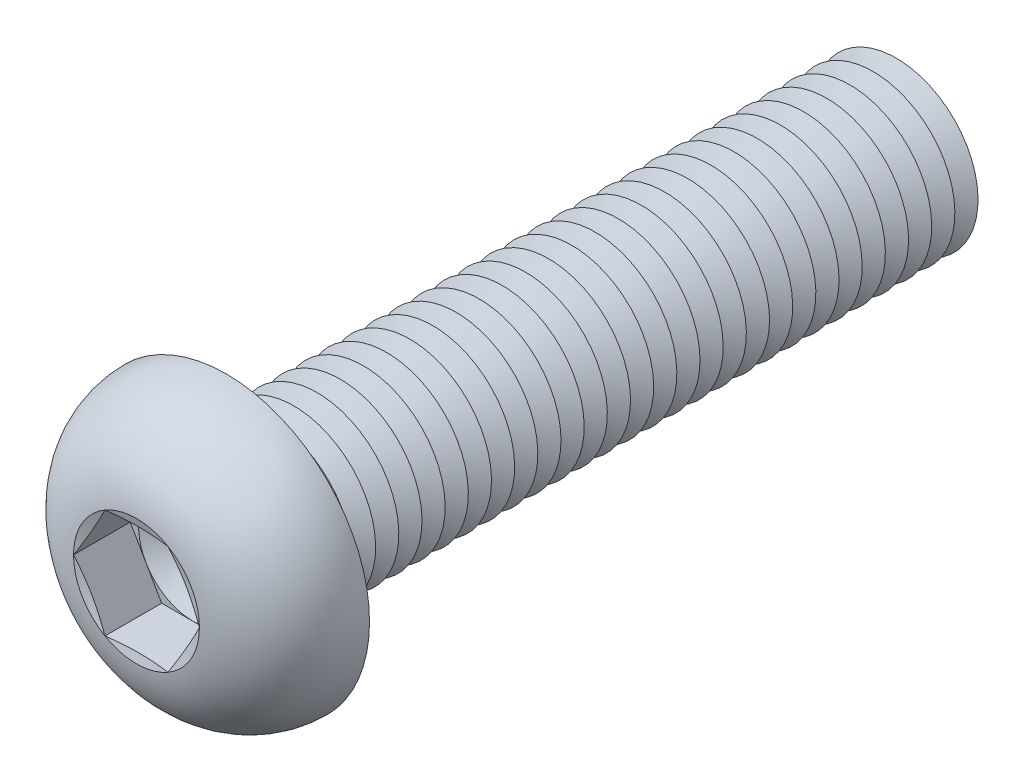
ISO-10303-21;
HEADER;
FILE_DESCRIPTION(('STEP AP214'),'2;1');
FILE_NAME('part.step','',(''),(''),'','','');
FILE_SCHEMA(('AUTOMOTIVE_DESIGN { 1 0 10303 214 1 1 1 1 }'));
ENDSEC;
DATA;
#1=APPLICATION_CONTEXT('core data for automotive mechanical design processes');
#2=APPLICATION_PROTOCOL_DEFINITION('international standard','automotive_design',2000,#1);
#3=PRODUCT_CONTEXT('',#1,'mechanical');
#4=PRODUCT('Part','Part','',(#3));
#5=PRODUCT_RELATED_PRODUCT_CATEGORY('part','',(#4));
#6=PRODUCT_DEFINITION_FORMATION('','',#4);
#7=PRODUCT_DEFINITION_CONTEXT('part definition',#1,'design');
#8=PRODUCT_DEFINITION('design','',#6,#7);
#9=PRODUCT_DEFINITION_SHAPE('','',#8);
#10=(LENGTH_UNIT() NAMED_UNIT(*) SI_UNIT(.MILLI.,.METRE.));
#11=(NAMED_UNIT(*) PLANE_ANGLE_UNIT() SI_UNIT($,.RADIAN.));
#12=(NAMED_UNIT(*) SI_UNIT($,.STERADIAN.) SOLID_ANGLE_UNIT());
#13=UNCERTAINTY_MEASURE_WITH_UNIT(LENGTH_MEASURE(1.E-05),#10,'distance_accuracy_value','');
#14=(GEOMETRIC_REPRESENTATION_CONTEXT(3) GLOBAL_UNCERTAINTY_ASSIGNED_CONTEXT((#13)) GLOBAL_UNIT_ASSIGNED_CONTEXT((#10,
#11,#12)) REPRESENTATION_CONTEXT('',''));
#15=CARTESIAN_POINT('',(0.,0.,0.));
#16=DIRECTION('',(0.,0.,1.));
#17=DIRECTION('',(1.,0.,0.));
#18=AXIS2_PLACEMENT_3D('',#15,#16,#17);
#19=CARTESIAN_POINT('',(0.,0.,2.43999999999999));
#20=DIRECTION('',(0.,0.,1.));
#21=DIRECTION('',(1.,0.,0.));
#22=AXIS2_PLACEMENT_3D('',#19,#20,#21);
#23=PLANE('',#22);
#24=CARTESIAN_POINT('',(0.,0.,2.43999999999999));
#25=DIRECTION('',(0.,0.,1.));
#26=DIRECTION('',(1.,0.,0.));
#27=AXIS2_PLACEMENT_3D('',#24,#25,#26);
#28=CIRCLE('',#27,3.99999813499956);
#29=CARTESIAN_POINT('',(3.4641,1.99999906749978,2.43999999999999));
#30=VERTEX_POINT('',#29);
#31=CARTESIAN_POINT('',(0.,3.99999813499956,2.43999999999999));
#32=VERTEX_POINT('',#31);
#33=EDGE_CURVE('E118',#30,#32,#28,.T.);
#34=ORIENTED_EDGE('',*,*,#33,.F.);
#35=DIRECTION('',(-0.5,0.866025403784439,0.));
#36=VECTOR('',#35,1.);
#37=CARTESIAN_POINT('',(4.6188,0.,2.43999999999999));
#38=LINE('',#37,#36);
#39=CARTESIAN_POINT('',(2.3094,3.99999813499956,2.43999999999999));
#40=VERTEX_POINT('',#39);
#41=EDGE_CURVE('E125',#30,#40,#38,.T.);
#42=ORIENTED_EDGE('',*,*,#41,.T.);
#43=DIRECTION('',(-1.,0.,0.));
#44=VECTOR('',#43,1.);
#45=CARTESIAN_POINT('',(2.3094,3.99999813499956,2.43999999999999));
#46=LINE('',#45,#44);
#47=EDGE_CURVE('E136',#40,#32,#46,.T.);
#48=ORIENTED_EDGE('',*,*,#47,.T.);
#49=EDGE_LOOP('',(#34,#42,#48));
#50=FACE_BOUND('',#49,.T.);
#51=ADVANCED_FACE('F39',(#50),#23,.T.);
#52=CARTESIAN_POINT('',(0.,0.,2.43999999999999));
#53=DIRECTION('',(0.,0.,1.));
#54=DIRECTION('',(1.,0.,0.));
#55=AXIS2_PLACEMENT_3D('',#52,#53,#54);
#56=CIRCLE('',#55,3.99999813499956);
#57=CARTESIAN_POINT('',(-3.4641,1.99999906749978,2.43999999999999));
#58=VERTEX_POINT('',#57);
#59=EDGE_CURVE('E11',#32,#58,#56,.T.);
#60=ORIENTED_EDGE('',*,*,#59,.F.);
#61=CARTESIAN_POINT('',(-2.3094,3.99999813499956,2.43999999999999));
#62=VERTEX_POINT('',#61);
#63=EDGE_CURVE('E131',#32,#62,#46,.T.);
#64=ORIENTED_EDGE('',*,*,#63,.T.);
#65=DIRECTION('',(-0.5,-0.866025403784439,0.));
#66=VECTOR('',#65,1.);
#67=CARTESIAN_POINT('',(-2.3094,3.99999813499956,2.43999999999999));
#68=LINE('',#67,#66);
#69=EDGE_CURVE('E134',#62,#58,#68,.T.);
#70=ORIENTED_EDGE('',*,*,#69,.T.);
#71=EDGE_LOOP('',(#60,#64,#70));
#72=FACE_BOUND('',#71,.T.);
#73=ADVANCED_FACE('F130',(#72),#23,.T.);
#74=CARTESIAN_POINT('',(-3.4641,-1.99999906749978,2.43999999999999));
#75=VERTEX_POINT('',#74);
#76=EDGE_CURVE('E49',#58,#75,#56,.T.);
#77=ORIENTED_EDGE('',*,*,#76,.F.);
#78=CARTESIAN_POINT('',(-4.6188,0.,2.43999999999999));
#79=VERTEX_POINT('',#78);
#80=EDGE_CURVE('E143',#58,#79,#68,.T.);
#81=ORIENTED_EDGE('',*,*,#80,.T.);
#82=DIRECTION('',(0.5,-0.866025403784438,0.));
#83=VECTOR('',#82,1.);
#84=CARTESIAN_POINT('',(-4.6188,0.,2.43999999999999));
#85=LINE('',#84,#83);
#86=EDGE_CURVE('E152',#79,#75,#85,.T.);
#87=ORIENTED_EDGE('',*,*,#86,.T.);
#88=EDGE_LOOP('',(#77,#81,#87));
#89=FACE_BOUND('',#88,.T.);
#90=ADVANCED_FACE('F506',(#89),#23,.T.);
#91=CARTESIAN_POINT('',(0.,-3.99999813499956,2.43999999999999));
#92=VERTEX_POINT('',#91);
#93=EDGE_CURVE('E487',#75,#92,#56,.T.);
#94=ORIENTED_EDGE('',*,*,#93,.F.);
#95=CARTESIAN_POINT('',(-2.3094,-3.99999813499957,2.43999999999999));
#96=VERTEX_POINT('',#95);
#97=EDGE_CURVE('E151',#75,#96,#85,.T.);
#98=ORIENTED_EDGE('',*,*,#97,.T.);
#99=DIRECTION('',(1.,0.,0.));
#100=VECTOR('',#99,1.);
#101=CARTESIAN_POINT('',(-2.3094,-3.99999813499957,2.43999999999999));
#102=LINE('',#101,#100);
#103=EDGE_CURVE('E157',#96,#92,#102,.T.);
#104=ORIENTED_EDGE('',*,*,#103,.T.);
#105=EDGE_LOOP('',(#94,#98,#104));
#106=FACE_BOUND('',#105,.T.);
#107=ADVANCED_FACE('F499',(#106),#23,.T.);
#108=CARTESIAN_POINT('',(3.4641,-1.99999906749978,2.43999999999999));
#109=VERTEX_POINT('',#108);
#110=EDGE_CURVE('E56',#92,#109,#56,.T.);
#111=ORIENTED_EDGE('',*,*,#110,.F.);
#112=CARTESIAN_POINT('',(2.3094,-3.99999813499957,2.43999999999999));
#113=VERTEX_POINT('',#112);
#114=EDGE_CURVE('E156',#92,#113,#102,.T.);
#115=ORIENTED_EDGE('',*,*,#114,.T.);
#116=DIRECTION('',(0.5,0.866025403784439,0.));
#117=VECTOR('',#116,1.);
#118=CARTESIAN_POINT('',(2.3094,-3.99999813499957,2.43999999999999));
#119=LINE('',#118,#117);
#120=EDGE_CURVE('E162',#113,#109,#119,.T.);
#121=ORIENTED_EDGE('',*,*,#120,.T.);
#122=EDGE_LOOP('',(#111,#115,#121));
#123=FACE_BOUND('',#122,.T.);
#124=ADVANCED_FACE('F574',(#123),#23,.T.);
#125=CARTESIAN_POINT('',(0.,0.,6.59999999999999));
#126=DIRECTION('',(0.,0.,1.));
#127=DIRECTION('',(0.,-1.,0.));
#128=AXIS2_PLACEMENT_3D('',#125,#126,#127);
#129=CONICAL_SURFACE('',#128,4.6188,1.30899693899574);
#130=CARTESIAN_POINT('',(4.61891547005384,-0.000200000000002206,6.6000309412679));
#131=CARTESIAN_POINT('',(4.52300232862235,0.165926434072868,6.57431944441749));
#132=CARTESIAN_POINT('',(4.42691527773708,0.332354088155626,6.55097758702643));
#133=CARTESIAN_POINT('',(4.23440181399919,0.665797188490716,6.50996805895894));
#134=CARTESIAN_POINT('',(4.13797527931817,0.83281284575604,6.49230269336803));
#135=CARTESIAN_POINT('',(3.94536752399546,1.16641926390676,6.46367750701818));
#136=CARTESIAN_POINT('',(3.84918760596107,1.33300776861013,6.45268354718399));
#137=CARTESIAN_POINT('',(3.6567051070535,1.66639723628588,6.4379417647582));
#138=CARTESIAN_POINT('',(3.56040255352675,1.83319815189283,6.43419253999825));
#139=CARTESIAN_POINT('',(3.36779744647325,2.16679998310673,6.43419253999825));
#140=CARTESIAN_POINT('',(3.2714948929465,2.33360089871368,6.4379417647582));
#141=CARTESIAN_POINT('',(3.07901239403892,2.66699036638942,6.45268354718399));
#142=CARTESIAN_POINT('',(2.98283247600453,2.8335788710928,6.46367750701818));
#143=CARTESIAN_POINT('',(2.79022472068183,3.16718528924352,6.49230269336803));
#144=CARTESIAN_POINT('',(2.69379818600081,3.33420094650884,6.50996805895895));
#145=CARTESIAN_POINT('',(2.50128472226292,3.66764404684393,6.55097758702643));
#146=CARTESIAN_POINT('',(2.40519767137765,3.83407170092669,6.57431944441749));
#147=CARTESIAN_POINT('',(2.30928452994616,4.00019813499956,6.6000309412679));
#148=B_SPLINE_CURVE_WITH_KNOTS('',3,(#130,#131,#132,#133,#134,#135,#136,#137,#138,#139,#140,
#141,#142,#143,#144,#145,#146,#147),.UNSPECIFIED.,.F.,.F.,(4,2,2,2,2,2,2,2,4),(0.,
0.580655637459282,1.16154676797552,1.73943971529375,2.31722080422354,2.89500189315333,
3.47289484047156,4.05378597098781,4.63444160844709),.UNSPECIFIED.);
#149=CARTESIAN_POINT('',(4.6188,0.,6.59999999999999));
#150=VERTEX_POINT('',#149);
#151=CARTESIAN_POINT('',(2.30940000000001,3.99999813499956,6.6));
#152=VERTEX_POINT('',#151);
#153=EDGE_CURVE('E222',#150,#152,#148,.T.);
#154=ORIENTED_EDGE('',*,*,#153,.F.);
#155=CARTESIAN_POINT('',(0.,0.,6.59999999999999));
#156=DIRECTION('',(0.,0.,-1.));
#157=DIRECTION('',(0.,1.,0.));
#158=AXIS2_PLACEMENT_3D('',#155,#156,#157);
#159=CIRCLE('',#158,4.6188);
#160=EDGE_CURVE('E468',#152,#150,#159,.T.);
#161=ORIENTED_EDGE('',*,*,#160,.F.);
#162=EDGE_LOOP('',(#154,#161));
#163=FACE_BOUND('',#162,.T.);
#164=ADVANCED_FACE('F578',(#163),#129,.F.);
#165=CARTESIAN_POINT('',(2.30928452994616,-4.00019813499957,6.6000309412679));
#166=CARTESIAN_POINT('',(2.40519767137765,-3.8340717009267,6.57431944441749));
#167=CARTESIAN_POINT('',(2.50128472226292,-3.66764404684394,6.55097758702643));
#168=CARTESIAN_POINT('',(2.69379818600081,-3.33420094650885,6.50996805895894));
#169=CARTESIAN_POINT('',(2.79022472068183,-3.16718528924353,6.49230269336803));
#170=CARTESIAN_POINT('',(2.98283247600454,-2.8335788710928,6.46367750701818));
#171=CARTESIAN_POINT('',(3.07901239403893,-2.66699036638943,6.45268354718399));
#172=CARTESIAN_POINT('',(3.2714948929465,-2.33360089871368,6.4379417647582));
#173=CARTESIAN_POINT('',(3.36779744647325,-2.16679998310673,6.43419253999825));
#174=CARTESIAN_POINT('',(3.56040255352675,-1.83319815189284,6.43419253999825));
#175=CARTESIAN_POINT('',(3.6567051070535,-1.66639723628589,6.4379417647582));
#176=CARTESIAN_POINT('',(3.84918760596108,-1.33300776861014,6.45268354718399));
#177=CARTESIAN_POINT('',(3.94536752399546,-1.16641926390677,6.46367750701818));
#178=CARTESIAN_POINT('',(4.13797527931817,-0.832812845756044,6.49230269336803));
#179=CARTESIAN_POINT('',(4.23440181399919,-0.66579718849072,6.50996805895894));
#180=CARTESIAN_POINT('',(4.42691527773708,-0.332354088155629,6.55097758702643));
#181=CARTESIAN_POINT('',(4.52300232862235,-0.165926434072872,6.57431944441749));
#182=CARTESIAN_POINT('',(4.61891547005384,0.000199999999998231,6.6000309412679));
#183=B_SPLINE_CURVE_WITH_KNOTS('',3,(#165,#166,#167,#168,#169,#170,#171,#172,#173,#174,#175,
#176,#177,#178,#179,#180,#181,#182),.UNSPECIFIED.,.F.,.F.,(4,2,2,2,2,2,2,2,4),(0.,
0.580655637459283,1.16154676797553,1.73943971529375,2.31722080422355,2.89500189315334,
3.47289484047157,4.05378597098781,4.63444160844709),.UNSPECIFIED.);
#184=CARTESIAN_POINT('',(2.3094,-3.99999813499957,6.59999999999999));
#185=VERTEX_POINT('',#184);
#186=EDGE_CURVE('E231',#185,#150,#183,.T.);
#187=ORIENTED_EDGE('',*,*,#186,.F.);
#188=EDGE_CURVE('E473',#150,#185,#159,.T.);
#189=ORIENTED_EDGE('',*,*,#188,.F.);
#190=EDGE_LOOP('',(#187,#189));
#191=FACE_BOUND('',#190,.T.);
#192=ADVANCED_FACE('F540',(#191),#129,.F.);
#193=CARTESIAN_POINT('',(-6.96966750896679,-3.99999813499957,7.51561854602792));
#194=CARTESIAN_POINT('',(-6.80094634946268,-3.99999813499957,7.47641178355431));
#195=CARTESIAN_POINT('',(-6.63214895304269,-3.99999813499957,7.43753277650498));
#196=CARTESIAN_POINT('',(-6.29436999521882,-3.99999813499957,7.36057075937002));
#197=CARTESIAN_POINT('',(-6.12538843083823,-3.99999813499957,7.3224877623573));
#198=CARTESIAN_POINT('',(-5.61806276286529,-3.99999813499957,7.20963087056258));
#199=CARTESIAN_POINT('',(-5.27940301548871,-3.99999813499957,7.13626437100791));
#200=CARTESIAN_POINT('',(-4.5977576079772,-3.99999813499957,6.99431141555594));
#201=CARTESIAN_POINT('',(-4.25476115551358,-3.99999813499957,6.92577621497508));
#202=CARTESIAN_POINT('',(-3.56716783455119,-3.99999813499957,6.79696563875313));
#203=CARTESIAN_POINT('',(-3.22257082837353,-3.99999813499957,6.73669098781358));
#204=CARTESIAN_POINT('',(-2.54069952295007,-3.99999813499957,6.63002020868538));
#205=CARTESIAN_POINT('',(-2.20347918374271,-3.99999813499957,6.58329286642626));
#206=CARTESIAN_POINT('',(-1.6962445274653,-3.99999813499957,6.52585827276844));
#207=CARTESIAN_POINT('',(-1.52694760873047,-3.99999813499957,6.50882377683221));
#208=CARTESIAN_POINT('',(-1.187938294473,-3.99999813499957,6.47963274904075));
#209=CARTESIAN_POINT('',(-1.01822592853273,-3.99999813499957,6.4674758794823));
#210=CARTESIAN_POINT('',(-0.679233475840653,-3.99999813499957,6.44863176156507));
#211=CARTESIAN_POINT('',(-0.509954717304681,-3.99999813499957,6.44192096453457));
#212=CARTESIAN_POINT('',(-0.171265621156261,-3.99999813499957,6.43422163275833));
#213=CARTESIAN_POINT('',(-0.00185528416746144,-3.99999813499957,6.43323307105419));
#214=CARTESIAN_POINT('',(0.336912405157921,-3.99999813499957,6.43703123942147));
#215=CARTESIAN_POINT('',(0.506269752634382,-3.99999813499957,6.44181839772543));
#216=CARTESIAN_POINT('',(0.844732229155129,-3.99999813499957,6.45691823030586));
#217=CARTESIAN_POINT('',(1.0138373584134,-3.99999813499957,6.46723089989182));
#218=CARTESIAN_POINT('',(1.4244995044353,-3.99999813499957,6.49843349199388));
#219=CARTESIAN_POINT('',(1.66585565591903,-3.99999813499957,6.52196685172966));
#220=CARTESIAN_POINT('',(2.14755410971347,-3.99999813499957,6.57749710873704));
#221=CARTESIAN_POINT('',(2.3878964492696,-3.99999813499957,6.60949369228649));
#222=CARTESIAN_POINT('',(2.86835569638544,-3.99999813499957,6.68017769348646));
#223=CARTESIAN_POINT('',(3.10846949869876,-3.99999813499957,6.71888590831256));
#224=CARTESIAN_POINT('',(3.5878341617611,-3.99999813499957,6.80132981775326));
#225=CARTESIAN_POINT('',(3.82708497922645,-3.99999813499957,6.84506576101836));
#226=CARTESIAN_POINT('',(4.30977392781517,-3.99999813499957,6.93726543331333));
#227=CARTESIAN_POINT('',(4.55319689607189,-3.99999813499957,6.98580793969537));
#228=CARTESIAN_POINT('',(5.03943022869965,-3.99999813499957,7.08586668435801));
#229=CARTESIAN_POINT('',(5.28224058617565,-3.99999813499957,7.13738295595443));
#230=CARTESIAN_POINT('',(5.76604885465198,-3.99999813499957,7.24238429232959));
#231=CARTESIAN_POINT('',(6.00704943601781,-3.99999813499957,7.29585711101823));
#232=CARTESIAN_POINT('',(6.48863948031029,-3.99999813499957,7.4045482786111));
#233=CARTESIAN_POINT('',(6.72922897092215,-3.99999813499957,7.45976650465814));
#234=CARTESIAN_POINT('',(6.9696675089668,-3.99999813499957,7.51561854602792));
#235=B_SPLINE_CURVE_WITH_KNOTS('',3,(#193,#194,#195,#196,#197,#198,#199,#200,#201,#202,#203,
#204,#205,#206,#207,#208,#209,#210,#211,#212,#213,#214,#215,#216,#217,#218,#219,#220,#221,#222,
#223,#224,#225,#226,#227,#228,#229,#230,#231,#232,#233,#234),.UNSPECIFIED.,.F.,.F.,(4,2,2,2,2,2,
2,2,2,2,2,2,2,2,2,2,2,2,2,2,4),(0.,0.519649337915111,1.03930720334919,2.07882421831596,
3.12808572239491,4.17743921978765,5.19841727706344,5.7088142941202,6.21917596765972,
6.7273189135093,7.23545946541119,7.74363769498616,8.25181549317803,8.9791183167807,
9.7063941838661,10.4359652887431,11.1655724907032,11.910195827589,12.6548275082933,
13.395405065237,14.1359306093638),.UNSPECIFIED.);
#236=CARTESIAN_POINT('',(-2.3094,-3.99999813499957,6.59999999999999));
#237=VERTEX_POINT('',#236);
#238=EDGE_CURVE('E519',#237,#185,#235,.T.);
#239=ORIENTED_EDGE('',*,*,#238,.F.);
#240=EDGE_CURVE('E532',#185,#237,#159,.T.);
#241=ORIENTED_EDGE('',*,*,#240,.F.);
#242=EDGE_LOOP('',(#239,#241));
#243=FACE_BOUND('',#242,.T.);
#244=ADVANCED_FACE('F545',(#243),#129,.F.);
#245=CARTESIAN_POINT('',(-4.61891547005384,0.000199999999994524,6.6000309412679));
#246=CARTESIAN_POINT('',(-4.52300232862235,-0.165926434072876,6.57431944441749));
#247=CARTESIAN_POINT('',(-4.42691527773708,-0.332354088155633,6.55097758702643));
#248=CARTESIAN_POINT('',(-4.23440181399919,-0.665797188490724,6.50996805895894));
#249=CARTESIAN_POINT('',(-4.13797527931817,-0.832812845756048,6.49230269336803));
#250=CARTESIAN_POINT('',(-3.94536752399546,-1.16641926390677,6.46367750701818));
#251=CARTESIAN_POINT('',(-3.84918760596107,-1.33300776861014,6.45268354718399));
#252=CARTESIAN_POINT('',(-3.6567051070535,-1.66639723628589,6.4379417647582));
#253=CARTESIAN_POINT('',(-3.56040255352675,-1.83319815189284,6.43419253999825));
#254=CARTESIAN_POINT('',(-3.36779744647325,-2.16679998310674,6.43419253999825));
#255=CARTESIAN_POINT('',(-3.2714948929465,-2.33360089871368,6.4379417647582));
#256=CARTESIAN_POINT('',(-3.07901239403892,-2.66699036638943,6.45268354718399));
#257=CARTESIAN_POINT('',(-2.98283247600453,-2.83357887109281,6.46367750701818));
#258=CARTESIAN_POINT('',(-2.79022472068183,-3.16718528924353,6.49230269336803));
#259=CARTESIAN_POINT('',(-2.69379818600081,-3.33420094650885,6.50996805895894));
#260=CARTESIAN_POINT('',(-2.50128472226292,-3.66764404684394,6.55097758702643));
#261=CARTESIAN_POINT('',(-2.40519767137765,-3.8340717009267,6.57431944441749));
#262=CARTESIAN_POINT('',(-2.30928452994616,-4.00019813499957,6.60003094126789));
#263=B_SPLINE_CURVE_WITH_KNOTS('',3,(#245,#246,#247,#248,#249,#250,#251,#252,#253,#254,#255,
#256,#257,#258,#259,#260,#261,#262),.UNSPECIFIED.,.F.,.F.,(4,2,2,2,2,2,2,2,4),(0.,
0.580655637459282,1.16154676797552,1.73943971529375,2.31722080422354,2.89500189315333,
3.47289484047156,4.05378597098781,4.63444160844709),.UNSPECIFIED.);
#264=CARTESIAN_POINT('',(-4.6188,0.,6.59999999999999));
#265=VERTEX_POINT('',#264);
#266=EDGE_CURVE('E511',#265,#237,#263,.T.);
#267=ORIENTED_EDGE('',*,*,#266,.F.);
#268=EDGE_CURVE('E517',#237,#265,#159,.T.);
#269=ORIENTED_EDGE('',*,*,#268,.F.);
#270=EDGE_LOOP('',(#267,#269));
#271=FACE_BOUND('',#270,.T.);
#272=ADVANCED_FACE('F515',(#271),#129,.F.);
#273=CARTESIAN_POINT('',(-2.30928452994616,4.00019813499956,6.6000309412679));
#274=CARTESIAN_POINT('',(-2.40519767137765,3.83407170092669,6.57431944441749));
#275=CARTESIAN_POINT('',(-2.50128472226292,3.66764404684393,6.55097758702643));
#276=CARTESIAN_POINT('',(-2.69379818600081,3.33420094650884,6.50996805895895));
#277=CARTESIAN_POINT('',(-2.79022472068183,3.16718528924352,6.49230269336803));
#278=CARTESIAN_POINT('',(-2.98283247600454,2.8335788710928,6.46367750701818));
#279=CARTESIAN_POINT('',(-3.07901239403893,2.66699036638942,6.45268354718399));
#280=CARTESIAN_POINT('',(-3.2714948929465,2.33360089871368,6.4379417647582));
#281=CARTESIAN_POINT('',(-3.36779744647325,2.16679998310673,6.43419253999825));
#282=CARTESIAN_POINT('',(-3.56040255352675,1.83319815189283,6.43419253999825));
#283=CARTESIAN_POINT('',(-3.6567051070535,1.66639723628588,6.4379417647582));
#284=CARTESIAN_POINT('',(-3.84918760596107,1.33300776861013,6.45268354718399));
#285=CARTESIAN_POINT('',(-3.94536752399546,1.16641926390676,6.46367750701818));
#286=CARTESIAN_POINT('',(-4.13797527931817,0.832812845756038,6.49230269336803));
#287=CARTESIAN_POINT('',(-4.23440181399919,0.665797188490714,6.50996805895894));
#288=CARTESIAN_POINT('',(-4.42691527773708,0.332354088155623,6.55097758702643));
#289=CARTESIAN_POINT('',(-4.52300232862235,0.165926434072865,6.57431944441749));
#290=CARTESIAN_POINT('',(-4.61891547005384,-0.000200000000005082,6.6000309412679));
#291=B_SPLINE_CURVE_WITH_KNOTS('',3,(#273,#274,#275,#276,#277,#278,#279,#280,#281,#282,#283,
#284,#285,#286,#287,#288,#289,#290),.UNSPECIFIED.,.F.,.F.,(4,2,2,2,2,2,2,2,4),(0.,
0.580655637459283,1.16154676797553,1.73943971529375,2.31722080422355,2.89500189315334,
3.47289484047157,4.05378597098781,4.63444160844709),.UNSPECIFIED.);
#292=CARTESIAN_POINT('',(-2.3094,3.99999813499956,6.59999999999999));
#293=VERTEX_POINT('',#292);
#294=EDGE_CURVE('E195',#293,#265,#291,.T.);
#295=ORIENTED_EDGE('',*,*,#294,.F.);
#296=EDGE_CURVE('E522',#265,#293,#159,.T.);
#297=ORIENTED_EDGE('',*,*,#296,.F.);
#298=EDGE_LOOP('',(#295,#297));
#299=FACE_BOUND('',#298,.T.);
#300=ADVANCED_FACE('F523',(#299),#129,.F.);
#301=CARTESIAN_POINT('',(0.,0.,-44.05));
#302=DIRECTION('',(0.,0.,1.));
#303=DIRECTION('',(0.,-1.,0.));
#304=AXIS2_PLACEMENT_3D('',#301,#302,#303);
#305=CONICAL_SURFACE('',#304,5.99999999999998,1.0471975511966);
#306=CARTESIAN_POINT('',(0.,0.,-44.9));
#307=DIRECTION('',(0.,0.,1.));
#308=DIRECTION('',(0.,-1.,0.));
#309=AXIS2_PLACEMENT_3D('',#306,#307,#308);
#310=CIRCLE('',#309,4.52775681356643);
#311=CARTESIAN_POINT('',(0.,-4.5277568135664,-44.9));
#312=VERTEX_POINT('',#311);
#313=EDGE_CURVE('E440',#312,#312,#310,.T.);
#314=ORIENTED_EDGE('',*,*,#313,.T.);
#315=EDGE_LOOP('',(#314));
#316=FACE_BOUND('',#315,.T.);
#317=CARTESIAN_POINT('',(0.,0.,-44.05));
#318=DIRECTION('',(0.,0.,1.));
#319=DIRECTION('',(0.,-1.,0.));
#320=AXIS2_PLACEMENT_3D('',#317,#318,#319);
#321=CIRCLE('',#320,5.99999999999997);
#322=CARTESIAN_POINT('',(0.,-5.99999999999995,-44.05));
#323=VERTEX_POINT('',#322);
#324=EDGE_CURVE('E436',#323,#323,#321,.T.);
#325=ORIENTED_EDGE('',*,*,#324,.F.);
#326=EDGE_LOOP('',(#325));
#327=FACE_BOUND('',#326,.T.);
#328=ADVANCED_FACE('F605',(#316,#327),#305,.T.);
#329=CARTESIAN_POINT('',(0.,0.,-44.9));
#330=DIRECTION('',(0.,0.,-1.));
#331=DIRECTION('',(0.,1.,0.));
#332=AXIS2_PLACEMENT_3D('',#329,#330,#331);
#333=CONICAL_SURFACE('',#332,4.52775681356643,1.0471975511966);
#334=CARTESIAN_POINT('',(0.,0.,-45.75));
#335=DIRECTION('',(0.,0.,1.));
#336=DIRECTION('',(0.,-1.,0.));
#337=AXIS2_PLACEMENT_3D('',#334,#335,#336);
#338=CIRCLE('',#337,5.99999999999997);
#339=CARTESIAN_POINT('',(0.,-5.99999999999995,-45.75));
#340=VERTEX_POINT('',#339);
#341=EDGE_CURVE('E444',#340,#340,#338,.T.);
#342=ORIENTED_EDGE('',*,*,#341,.T.);
#343=EDGE_LOOP('',(#342));
#344=FACE_BOUND('',#343,.T.);
#345=ORIENTED_EDGE('',*,*,#313,.F.);
#346=EDGE_LOOP('',(#345));
#347=FACE_BOUND('',#346,.T.);
#348=ADVANCED_FACE('F610',(#344,#347),#333,.T.);
#349=CARTESIAN_POINT('',(0.,5.99999999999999,-50.));
#350=DIRECTION('',(0.,0.,-1.));
#351=DIRECTION('',(0.,1.,0.));
#352=AXIS2_PLACEMENT_3D('',#349,#350,#351);
#353=PLANE('',#352);
#354=CARTESIAN_POINT('',(0.,0.,-50.));
#355=DIRECTION('',(0.,0.,1.));
#356=DIRECTION('',(0.,-1.,0.));
#357=AXIS2_PLACEMENT_3D('',#354,#355,#356);
#358=CIRCLE('',#357,4.52775681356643);
#359=CARTESIAN_POINT('',(0.,-4.5277568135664,-50.));
#360=VERTEX_POINT('',#359);
#361=EDGE_CURVE('E463',#360,#360,#358,.T.);
#362=ORIENTED_EDGE('',*,*,#361,.F.);
#363=EDGE_LOOP('',(#362));
#364=FACE_BOUND('',#363,.T.);
#365=ADVANCED_FACE('F785',(#364),#353,.T.);
#366=CARTESIAN_POINT('',(0.,0.,-49.15));
#367=DIRECTION('',(0.,0.,1.));
#368=DIRECTION('',(0.,-1.,0.));
#369=AXIS2_PLACEMENT_3D('',#366,#367,#368);
#370=CONICAL_SURFACE('',#369,5.99999999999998,1.0471975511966);
#371=ORIENTED_EDGE('',*,*,#361,.T.);
#372=EDGE_LOOP('',(#371));
#373=FACE_BOUND('',#372,.T.);
#374=CARTESIAN_POINT('',(0.,0.,-49.15));
#375=DIRECTION('',(0.,0.,1.));
#376=DIRECTION('',(0.,-1.,0.));
#377=AXIS2_PLACEMENT_3D('',#374,#375,#376);
#378=CIRCLE('',#377,5.99999999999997);
#379=CARTESIAN_POINT('',(0.,-5.99999999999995,-49.15));
#380=VERTEX_POINT('',#379);
#381=EDGE_CURVE('E459',#380,#380,#378,.T.);
#382=ORIENTED_EDGE('',*,*,#381,.F.);
#383=EDGE_LOOP('',(#382));
#384=FACE_BOUND('',#383,.T.);
#385=ADVANCED_FACE('F778',(#373,#384),#370,.T.);
#386=CARTESIAN_POINT('',(0.,0.,-48.3));
#387=DIRECTION('',(0.,0.,-1.));
#388=DIRECTION('',(0.,1.,0.));
#389=AXIS2_PLACEMENT_3D('',#386,#387,#388);
#390=CONICAL_SURFACE('',#389,4.52775681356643,1.0471975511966);
#391=ORIENTED_EDGE('',*,*,#381,.T.);
#392=EDGE_LOOP('',(#391));
#393=FACE_BOUND('',#392,.T.);
#394=CARTESIAN_POINT('',(0.,0.,-48.3));
#395=DIRECTION('',(0.,0.,1.));
#396=DIRECTION('',(0.,-1.,0.));
#397=AXIS2_PLACEMENT_3D('',#394,#395,#396);
#398=CIRCLE('',#397,4.52775681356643);
#399=CARTESIAN_POINT('',(0.,-4.5277568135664,-48.3));
#400=VERTEX_POINT('',#399);
#401=EDGE_CURVE('E455',#400,#400,#398,.T.);
#402=ORIENTED_EDGE('',*,*,#401,.F.);
#403=EDGE_LOOP('',(#402));
#404=FACE_BOUND('',#403,.T.);
#405=ADVANCED_FACE('F784',(#393,#404),#390,.T.);
#406=CARTESIAN_POINT('',(0.,0.,-47.45));
#407=DIRECTION('',(0.,0.,1.));
#408=DIRECTION('',(0.,-1.,0.));
#409=AXIS2_PLACEMENT_3D('',#406,#407,#408);
#410=CONICAL_SURFACE('',#409,5.99999999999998,1.0471975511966);
#411=ORIENTED_EDGE('',*,*,#401,.T.);
#412=EDGE_LOOP('',(#411));
#413=FACE_BOUND('',#412,.T.);
#414=CARTESIAN_POINT('',(0.,0.,-47.45));
#415=DIRECTION('',(0.,0.,1.));
#416=DIRECTION('',(0.,-1.,0.));
#417=AXIS2_PLACEMENT_3D('',#414,#415,#416);
#418=CIRCLE('',#417,5.99999999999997);
#419=CARTESIAN_POINT('',(0.,-5.99999999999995,-47.45));
#420=VERTEX_POINT('',#419);
#421=EDGE_CURVE('E451',#420,#420,#418,.T.);
#422=ORIENTED_EDGE('',*,*,#421,.F.);
#423=EDGE_LOOP('',(#422));
#424=FACE_BOUND('',#423,.T.);
#425=ADVANCED_FACE('F816',(#413,#424),#410,.T.);
#426=CARTESIAN_POINT('',(0.,0.,-46.6));
#427=DIRECTION('',(0.,0.,-1.));
#428=DIRECTION('',(0.,1.,0.));
#429=AXIS2_PLACEMENT_3D('',#426,#427,#428);
#430=CONICAL_SURFACE('',#429,4.52775681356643,1.0471975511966);
#431=ORIENTED_EDGE('',*,*,#421,.T.);
#432=EDGE_LOOP('',(#431));
#433=FACE_BOUND('',#432,.T.);
#434=CARTESIAN_POINT('',(0.,0.,-46.6));
#435=DIRECTION('',(0.,0.,1.));
#436=DIRECTION('',(0.,-1.,0.));
#437=AXIS2_PLACEMENT_3D('',#434,#435,#436);
#438=CIRCLE('',#437,4.52775681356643);
#439=CARTESIAN_POINT('',(0.,-4.5277568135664,-46.6));
#440=VERTEX_POINT('',#439);
#441=EDGE_CURVE('E447',#440,#440,#438,.T.);
#442=ORIENTED_EDGE('',*,*,#441,.F.);
#443=EDGE_LOOP('',(#442));
#444=FACE_BOUND('',#443,.T.);
#445=ADVANCED_FACE('F826',(#433,#444),#430,.T.);
#446=CARTESIAN_POINT('',(0.,0.,-45.75));
#447=DIRECTION('',(0.,0.,1.));
#448=DIRECTION('',(0.,-1.,0.));
#449=AXIS2_PLACEMENT_3D('',#446,#447,#448);
#450=CONICAL_SURFACE('',#449,5.99999999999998,1.0471975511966);
#451=ORIENTED_EDGE('',*,*,#441,.T.);
#452=EDGE_LOOP('',(#451));
#453=FACE_BOUND('',#452,.T.);
#454=ORIENTED_EDGE('',*,*,#341,.F.);
#455=EDGE_LOOP('',(#454));
#456=FACE_BOUND('',#455,.T.);
#457=ADVANCED_FACE('F836',(#453,#456),#450,.T.);
#458=CARTESIAN_POINT('',(0.,0.,-42.35));
#459=DIRECTION('',(0.,0.,1.));
#460=DIRECTION('',(0.,-1.,0.));
#461=AXIS2_PLACEMENT_3D('',#458,#459,#460);
#462=CONICAL_SURFACE('',#461,5.99999999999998,1.0471975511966);
#463=CARTESIAN_POINT('',(0.,0.,-43.2));
#464=DIRECTION('',(0.,0.,1.));
#465=DIRECTION('',(0.,-1.,0.));
#466=AXIS2_PLACEMENT_3D('',#463,#464,#465);
#467=CIRCLE('',#466,4.52775681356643);
#468=CARTESIAN_POINT('',(0.,-4.52775681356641,-43.2));
#469=VERTEX_POINT('',#468);
#470=EDGE_CURVE('E432',#469,#469,#467,.T.);
#471=ORIENTED_EDGE('',*,*,#470,.T.);
#472=EDGE_LOOP('',(#471));
#473=FACE_BOUND('',#472,.T.);
#474=CARTESIAN_POINT('',(0.,0.,-42.35));
#475=DIRECTION('',(0.,0.,1.));
#476=DIRECTION('',(0.,-1.,0.));
#477=AXIS2_PLACEMENT_3D('',#474,#475,#476);
#478=CIRCLE('',#477,5.99999999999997);
#479=CARTESIAN_POINT('',(0.,-5.99999999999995,-42.35));
#480=VERTEX_POINT('',#479);
#481=EDGE_CURVE('E428',#480,#480,#478,.T.);
#482=ORIENTED_EDGE('',*,*,#481,.F.);
#483=EDGE_LOOP('',(#482));
#484=FACE_BOUND('',#483,.T.);
#485=ADVANCED_FACE('F846',(#473,#484),#462,.T.);
#486=CARTESIAN_POINT('',(0.,0.,-43.2));
#487=DIRECTION('',(0.,0.,-1.));
#488=DIRECTION('',(0.,1.,0.));
#489=AXIS2_PLACEMENT_3D('',#486,#487,#488);
#490=CONICAL_SURFACE('',#489,4.52775681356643,1.0471975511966);
#491=ORIENTED_EDGE('',*,*,#324,.T.);
#492=EDGE_LOOP('',(#491));
#493=FACE_BOUND('',#492,.T.);
#494=ORIENTED_EDGE('',*,*,#470,.F.);
#495=EDGE_LOOP('',(#494));
#496=FACE_BOUND('',#495,.T.);
#497=ADVANCED_FACE('F856',(#493,#496),#490,.T.);
#498=CARTESIAN_POINT('',(0.,0.,-40.65));
#499=DIRECTION('',(0.,0.,1.));
#500=DIRECTION('',(0.,-1.,0.));
#501=AXIS2_PLACEMENT_3D('',#498,#499,#500);
#502=CONICAL_SURFACE('',#501,5.99999999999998,1.0471975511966);
#503=CARTESIAN_POINT('',(0.,0.,-41.5));
#504=DIRECTION('',(0.,0.,1.));
#505=DIRECTION('',(0.,-1.,0.));
#506=AXIS2_PLACEMENT_3D('',#503,#504,#505);
#507=CIRCLE('',#506,4.52775681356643);
#508=CARTESIAN_POINT('',(0.,-4.52775681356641,-41.5));
#509=VERTEX_POINT('',#508);
#510=EDGE_CURVE('E424',#509,#509,#507,.T.);
#511=ORIENTED_EDGE('',*,*,#510,.T.);
#512=EDGE_LOOP('',(#511));
#513=FACE_BOUND('',#512,.T.);
#514=CARTESIAN_POINT('',(0.,0.,-40.65));
#515=DIRECTION('',(0.,0.,1.));
#516=DIRECTION('',(0.,-1.,0.));
#517=AXIS2_PLACEMENT_3D('',#514,#515,#516);
#518=CIRCLE('',#517,5.99999999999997);
#519=CARTESIAN_POINT('',(0.,-5.99999999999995,-40.65));
#520=VERTEX_POINT('',#519);
#521=EDGE_CURVE('E420',#520,#520,#518,.T.);
#522=ORIENTED_EDGE('',*,*,#521,.F.);
#523=EDGE_LOOP('',(#522));
#524=FACE_BOUND('',#523,.T.);
#525=ADVANCED_FACE('F866',(#513,#524),#502,.T.);
#526=CARTESIAN_POINT('',(0.,0.,-41.5));
#527=DIRECTION('',(0.,0.,-1.));
#528=DIRECTION('',(0.,1.,0.));
#529=AXIS2_PLACEMENT_3D('',#526,#527,#528);
#530=CONICAL_SURFACE('',#529,4.52775681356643,1.0471975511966);
#531=ORIENTED_EDGE('',*,*,#481,.T.);
#532=EDGE_LOOP('',(#531));
#533=FACE_BOUND('',#532,.T.);
#534=ORIENTED_EDGE('',*,*,#510,.F.);
#535=EDGE_LOOP('',(#534));
#536=FACE_BOUND('',#535,.T.);
#537=ADVANCED_FACE('F876',(#533,#536),#530,.T.);
#538=CARTESIAN_POINT('',(0.,0.,-38.95));
#539=DIRECTION('',(0.,0.,1.));
#540=DIRECTION('',(0.,-1.,0.));
#541=AXIS2_PLACEMENT_3D('',#538,#539,#540);
#542=CONICAL_SURFACE('',#541,5.99999999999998,1.0471975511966);
#543=CARTESIAN_POINT('',(0.,0.,-39.8));
#544=DIRECTION('',(0.,0.,1.));
#545=DIRECTION('',(0.,-1.,0.));
#546=AXIS2_PLACEMENT_3D('',#543,#544,#545);
#547=CIRCLE('',#546,4.52775681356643);
#548=CARTESIAN_POINT('',(0.,-4.52775681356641,-39.8));
#549=VERTEX_POINT('',#548);
#550=EDGE_CURVE('E416',#549,#549,#547,.T.);
#551=ORIENTED_EDGE('',*,*,#550,.T.);
#552=EDGE_LOOP('',(#551));
#553=FACE_BOUND('',#552,.T.);
#554=CARTESIAN_POINT('',(0.,0.,-38.95));
#555=DIRECTION('',(0.,0.,1.));
#556=DIRECTION('',(0.,-1.,0.));
#557=AXIS2_PLACEMENT_3D('',#554,#555,#556);
#558=CIRCLE('',#557,5.99999999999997);
#559=CARTESIAN_POINT('',(0.,-5.99999999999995,-38.95));
#560=VERTEX_POINT('',#559);
#561=EDGE_CURVE('E412',#560,#560,#558,.T.);
#562=ORIENTED_EDGE('',*,*,#561,.F.);
#563=EDGE_LOOP('',(#562));
#564=FACE_BOUND('',#563,.T.);
#565=ADVANCED_FACE('F886',(#553,#564),#542,.T.);
#566=CARTESIAN_POINT('',(0.,0.,-39.8));
#567=DIRECTION('',(0.,0.,-1.));
#568=DIRECTION('',(0.,1.,0.));
#569=AXIS2_PLACEMENT_3D('',#566,#567,#568);
#570=CONICAL_SURFACE('',#569,4.52775681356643,1.0471975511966);
#571=ORIENTED_EDGE('',*,*,#521,.T.);
#572=EDGE_LOOP('',(#571));
#573=FACE_BOUND('',#572,.T.);
#574=ORIENTED_EDGE('',*,*,#550,.F.);
#575=EDGE_LOOP('',(#574));
#576=FACE_BOUND('',#575,.T.);
#577=ADVANCED_FACE('F896',(#573,#576),#570,.T.);
#578=CARTESIAN_POINT('',(0.,0.,-37.25));
#579=DIRECTION('',(0.,0.,1.));
#580=DIRECTION('',(0.,-1.,0.));
#581=AXIS2_PLACEMENT_3D('',#578,#579,#580);
#582=CONICAL_SURFACE('',#581,5.99999999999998,1.0471975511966);
#583=CARTESIAN_POINT('',(0.,0.,-38.1));
#584=DIRECTION('',(0.,0.,1.));
#585=DIRECTION('',(0.,-1.,0.));
#586=AXIS2_PLACEMENT_3D('',#583,#584,#585);
#587=CIRCLE('',#586,4.52775681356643);
#588=CARTESIAN_POINT('',(0.,-4.52775681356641,-38.1));
#589=VERTEX_POINT('',#588);
#590=EDGE_CURVE('E408',#589,#589,#587,.T.);
#591=ORIENTED_EDGE('',*,*,#590,.T.);
#592=EDGE_LOOP('',(#591));
#593=FACE_BOUND('',#592,.T.);
#594=CARTESIAN_POINT('',(0.,0.,-37.25));
#595=DIRECTION('',(0.,0.,1.));
#596=DIRECTION('',(0.,-1.,0.));
#597=AXIS2_PLACEMENT_3D('',#594,#595,#596);
#598=CIRCLE('',#597,5.99999999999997);
#599=CARTESIAN_POINT('',(0.,-5.99999999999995,-37.25));
#600=VERTEX_POINT('',#599);
#601=EDGE_CURVE('E404',#600,#600,#598,.T.);
#602=ORIENTED_EDGE('',*,*,#601,.F.);
#603=EDGE_LOOP('',(#602));
#604=FACE_BOUND('',#603,.T.);
#605=ADVANCED_FACE('F906',(#593,#604),#582,.T.);
#606=CARTESIAN_POINT('',(0.,0.,-38.1));
#607=DIRECTION('',(0.,0.,-1.));
#608=DIRECTION('',(0.,1.,0.));
#609=AXIS2_PLACEMENT_3D('',#606,#607,#608);
#610=CONICAL_SURFACE('',#609,4.52775681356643,1.0471975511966);
#611=ORIENTED_EDGE('',*,*,#561,.T.);
#612=EDGE_LOOP('',(#611));
#613=FACE_BOUND('',#612,.T.);
#614=ORIENTED_EDGE('',*,*,#590,.F.);
#615=EDGE_LOOP('',(#614));
#616=FACE_BOUND('',#615,.T.);
#617=ADVANCED_FACE('F916',(#613,#616),#610,.T.);
#618=CARTESIAN_POINT('',(0.,0.,-35.55));
#619=DIRECTION('',(0.,0.,1.));
#620=DIRECTION('',(0.,-1.,0.));
#621=AXIS2_PLACEMENT_3D('',#618,#619,#620);
#622=CONICAL_SURFACE('',#621,5.99999999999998,1.0471975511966);
#623=CARTESIAN_POINT('',(0.,0.,-36.4));
#624=DIRECTION('',(0.,0.,1.));
#625=DIRECTION('',(0.,-1.,0.));
#626=AXIS2_PLACEMENT_3D('',#623,#624,#625);
#627=CIRCLE('',#626,4.52775681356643);
#628=CARTESIAN_POINT('',(0.,-4.52775681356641,-36.4));
#629=VERTEX_POINT('',#628);
#630=EDGE_CURVE('E400',#629,#629,#627,.T.);
#631=ORIENTED_EDGE('',*,*,#630,.T.);
#632=EDGE_LOOP('',(#631));
#633=FACE_BOUND('',#632,.T.);
#634=CARTESIAN_POINT('',(0.,0.,-35.55));
#635=DIRECTION('',(0.,0.,1.));
#636=DIRECTION('',(0.,-1.,0.));
#637=AXIS2_PLACEMENT_3D('',#634,#635,#636);
#638=CIRCLE('',#637,5.99999999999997);
#639=CARTESIAN_POINT('',(0.,-5.99999999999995,-35.55));
#640=VERTEX_POINT('',#639);
#641=EDGE_CURVE('E396',#640,#640,#638,.T.);
#642=ORIENTED_EDGE('',*,*,#641,.F.);
#643=EDGE_LOOP('',(#642));
#644=FACE_BOUND('',#643,.T.);
#645=ADVANCED_FACE('F926',(#633,#644),#622,.T.);
#646=CARTESIAN_POINT('',(0.,0.,-36.4));
#647=DIRECTION('',(0.,0.,-1.));
#648=DIRECTION('',(0.,1.,0.));
#649=AXIS2_PLACEMENT_3D('',#646,#647,#648);
#650=CONICAL_SURFACE('',#649,4.52775681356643,1.0471975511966);
#651=ORIENTED_EDGE('',*,*,#601,.T.);
#652=EDGE_LOOP('',(#651));
#653=FACE_BOUND('',#652,.T.);
#654=ORIENTED_EDGE('',*,*,#630,.F.);
#655=EDGE_LOOP('',(#654));
#656=FACE_BOUND('',#655,.T.);
#657=ADVANCED_FACE('F936',(#653,#656),#650,.T.);
#658=CARTESIAN_POINT('',(0.,0.,-33.85));
#659=DIRECTION('',(0.,0.,1.));
#660=DIRECTION('',(0.,-1.,0.));
#661=AXIS2_PLACEMENT_3D('',#658,#659,#660);
#662=CONICAL_SURFACE('',#661,5.99999999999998,1.0471975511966);
#663=CARTESIAN_POINT('',(0.,0.,-34.7));
#664=DIRECTION('',(0.,0.,1.));
#665=DIRECTION('',(0.,-1.,0.));
#666=AXIS2_PLACEMENT_3D('',#663,#664,#665);
#667=CIRCLE('',#666,4.52775681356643);
#668=CARTESIAN_POINT('',(0.,-4.52775681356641,-34.7));
#669=VERTEX_POINT('',#668);
#670=EDGE_CURVE('E392',#669,#669,#667,.T.);
#671=ORIENTED_EDGE('',*,*,#670,.T.);
#672=EDGE_LOOP('',(#671));
#673=FACE_BOUND('',#672,.T.);
#674=CARTESIAN_POINT('',(0.,0.,-33.85));
#675=DIRECTION('',(0.,0.,1.));
#676=DIRECTION('',(0.,-1.,0.));
#677=AXIS2_PLACEMENT_3D('',#674,#675,#676);
#678=CIRCLE('',#677,5.99999999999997);
#679=CARTESIAN_POINT('',(0.,-5.99999999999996,-33.85));
#680=VERTEX_POINT('',#679);
#681=EDGE_CURVE('E388',#680,#680,#678,.T.);
#682=ORIENTED_EDGE('',*,*,#681,.F.);
#683=EDGE_LOOP('',(#682));
#684=FACE_BOUND('',#683,.T.);
#685=ADVANCED_FACE('F946',(#673,#684),#662,.T.);
#686=CARTESIAN_POINT('',(0.,0.,-34.7));
#687=DIRECTION('',(0.,0.,-1.));
#688=DIRECTION('',(0.,1.,0.));
#689=AXIS2_PLACEMENT_3D('',#686,#687,#688);
#690=CONICAL_SURFACE('',#689,4.52775681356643,1.0471975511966);
#691=ORIENTED_EDGE('',*,*,#641,.T.);
#692=EDGE_LOOP('',(#691));
#693=FACE_BOUND('',#692,.T.);
#694=ORIENTED_EDGE('',*,*,#670,.F.);
#695=EDGE_LOOP('',(#694));
#696=FACE_BOUND('',#695,.T.);
#697=ADVANCED_FACE('F956',(#693,#696),#690,.T.);
#698=CARTESIAN_POINT('',(0.,0.,-32.15));
#699=DIRECTION('',(0.,0.,1.));
#700=DIRECTION('',(0.,-1.,0.));
#701=AXIS2_PLACEMENT_3D('',#698,#699,#700);
#702=CONICAL_SURFACE('',#701,5.99999999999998,1.0471975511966);
#703=CARTESIAN_POINT('',(0.,0.,-33.));
#704=DIRECTION('',(0.,0.,1.));
#705=DIRECTION('',(0.,-1.,0.));
#706=AXIS2_PLACEMENT_3D('',#703,#704,#705);
#707=CIRCLE('',#706,4.52775681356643);
#708=CARTESIAN_POINT('',(0.,-4.52775681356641,-33.));
#709=VERTEX_POINT('',#708);
#710=EDGE_CURVE('E384',#709,#709,#707,.T.);
#711=ORIENTED_EDGE('',*,*,#710,.T.);
#712=EDGE_LOOP('',(#711));
#713=FACE_BOUND('',#712,.T.);
#714=CARTESIAN_POINT('',(0.,0.,-32.15));
#715=DIRECTION('',(0.,0.,1.));
#716=DIRECTION('',(0.,-1.,0.));
#717=AXIS2_PLACEMENT_3D('',#714,#715,#716);
#718=CIRCLE('',#717,5.99999999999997);
#719=CARTESIAN_POINT('',(0.,-5.99999999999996,-32.15));
#720=VERTEX_POINT('',#719);
#721=EDGE_CURVE('E380',#720,#720,#718,.T.);
#722=ORIENTED_EDGE('',*,*,#721,.F.);
#723=EDGE_LOOP('',(#722));
#724=FACE_BOUND('',#723,.T.);
#725=ADVANCED_FACE('F966',(#713,#724),#702,.T.);
#726=CARTESIAN_POINT('',(0.,0.,-33.));
#727=DIRECTION('',(0.,0.,-1.));
#728=DIRECTION('',(0.,1.,0.));
#729=AXIS2_PLACEMENT_3D('',#726,#727,#728);
#730=CONICAL_SURFACE('',#729,4.52775681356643,1.0471975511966);
#731=ORIENTED_EDGE('',*,*,#681,.T.);
#732=EDGE_LOOP('',(#731));
#733=FACE_BOUND('',#732,.T.);
#734=ORIENTED_EDGE('',*,*,#710,.F.);
#735=EDGE_LOOP('',(#734));
#736=FACE_BOUND('',#735,.T.);
#737=ADVANCED_FACE('F976',(#733,#736),#730,.T.);
#738=CARTESIAN_POINT('',(0.,0.,-30.45));
#739=DIRECTION('',(0.,0.,1.));
#740=DIRECTION('',(0.,-1.,0.));
#741=AXIS2_PLACEMENT_3D('',#738,#739,#740);
#742=CONICAL_SURFACE('',#741,5.99999999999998,1.0471975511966);
#743=CARTESIAN_POINT('',(0.,0.,-31.3));
#744=DIRECTION('',(0.,0.,1.));
#745=DIRECTION('',(0.,-1.,0.));
#746=AXIS2_PLACEMENT_3D('',#743,#744,#745);
#747=CIRCLE('',#746,4.52775681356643);
#748=CARTESIAN_POINT('',(0.,-4.52775681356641,-31.3));
#749=VERTEX_POINT('',#748);
#750=EDGE_CURVE('E376',#749,#749,#747,.T.);
#751=ORIENTED_EDGE('',*,*,#750,.T.);
#752=EDGE_LOOP('',(#751));
#753=FACE_BOUND('',#752,.T.);
#754=CARTESIAN_POINT('',(0.,0.,-30.45));
#755=DIRECTION('',(0.,0.,1.));
#756=DIRECTION('',(0.,-1.,0.));
#757=AXIS2_PLACEMENT_3D('',#754,#755,#756);
#758=CIRCLE('',#757,5.99999999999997);
#759=CARTESIAN_POINT('',(0.,-5.99999999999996,-30.45));
#760=VERTEX_POINT('',#759);
#761=EDGE_CURVE('E372',#760,#760,#758,.T.);
#762=ORIENTED_EDGE('',*,*,#761,.F.);
#763=EDGE_LOOP('',(#762));
#764=FACE_BOUND('',#763,.T.);
#765=ADVANCED_FACE('F986',(#753,#764),#742,.T.);
#766=CARTESIAN_POINT('',(0.,0.,-31.3));
#767=DIRECTION('',(0.,0.,-1.));
#768=DIRECTION('',(0.,1.,0.));
#769=AXIS2_PLACEMENT_3D('',#766,#767,#768);
#770=CONICAL_SURFACE('',#769,4.52775681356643,1.0471975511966);
#771=ORIENTED_EDGE('',*,*,#721,.T.);
#772=EDGE_LOOP('',(#771));
#773=FACE_BOUND('',#772,.T.);
#774=ORIENTED_EDGE('',*,*,#750,.F.);
#775=EDGE_LOOP('',(#774));
#776=FACE_BOUND('',#775,.T.);
#777=ADVANCED_FACE('F996',(#773,#776),#770,.T.);
#778=CARTESIAN_POINT('',(0.,0.,-28.75));
#779=DIRECTION('',(0.,0.,1.));
#780=DIRECTION('',(0.,-1.,0.));
#781=AXIS2_PLACEMENT_3D('',#778,#779,#780);
#782=CONICAL_SURFACE('',#781,5.99999999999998,1.0471975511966);
#783=CARTESIAN_POINT('',(0.,0.,-29.6));
#784=DIRECTION('',(0.,0.,1.));
#785=DIRECTION('',(0.,-1.,0.));
#786=AXIS2_PLACEMENT_3D('',#783,#784,#785);
#787=CIRCLE('',#786,4.52775681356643);
#788=CARTESIAN_POINT('',(0.,-4.52775681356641,-29.6));
#789=VERTEX_POINT('',#788);
#790=EDGE_CURVE('E368',#789,#789,#787,.T.);
#791=ORIENTED_EDGE('',*,*,#790,.T.);
#792=EDGE_LOOP('',(#791));
#793=FACE_BOUND('',#792,.T.);
#794=CARTESIAN_POINT('',(0.,0.,-28.75));
#795=DIRECTION('',(0.,0.,1.));
#796=DIRECTION('',(0.,-1.,0.));
#797=AXIS2_PLACEMENT_3D('',#794,#795,#796);
#798=CIRCLE('',#797,5.99999999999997);
#799=CARTESIAN_POINT('',(0.,-5.99999999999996,-28.75));
#800=VERTEX_POINT('',#799);
#801=EDGE_CURVE('E364',#800,#800,#798,.T.);
#802=ORIENTED_EDGE('',*,*,#801,.F.);
#803=EDGE_LOOP('',(#802));
#804=FACE_BOUND('',#803,.T.);
#805=ADVANCED_FACE('F1006',(#793,#804),#782,.T.);
#806=CARTESIAN_POINT('',(0.,0.,-29.6));
#807=DIRECTION('',(0.,0.,-1.));
#808=DIRECTION('',(0.,1.,0.));
#809=AXIS2_PLACEMENT_3D('',#806,#807,#808);
#810=CONICAL_SURFACE('',#809,4.52775681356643,1.0471975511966);
#811=ORIENTED_EDGE('',*,*,#761,.T.);
#812=EDGE_LOOP('',(#811));
#813=FACE_BOUND('',#812,.T.);
#814=ORIENTED_EDGE('',*,*,#790,.F.);
#815=EDGE_LOOP('',(#814));
#816=FACE_BOUND('',#815,.T.);
#817=ADVANCED_FACE('F1016',(#813,#816),#810,.T.);
#818=CARTESIAN_POINT('',(0.,0.,-27.05));
#819=DIRECTION('',(0.,0.,1.));
#820=DIRECTION('',(0.,-1.,0.));
#821=AXIS2_PLACEMENT_3D('',#818,#819,#820);
#822=CONICAL_SURFACE('',#821,5.99999999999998,1.0471975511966);
#823=CARTESIAN_POINT('',(0.,0.,-27.9));
#824=DIRECTION('',(0.,0.,1.));
#825=DIRECTION('',(0.,-1.,0.));
#826=AXIS2_PLACEMENT_3D('',#823,#824,#825);
#827=CIRCLE('',#826,4.52775681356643);
#828=CARTESIAN_POINT('',(0.,-4.52775681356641,-27.9));
#829=VERTEX_POINT('',#828);
#830=EDGE_CURVE('E360',#829,#829,#827,.T.);
#831=ORIENTED_EDGE('',*,*,#830,.T.);
#832=EDGE_LOOP('',(#831));
#833=FACE_BOUND('',#832,.T.);
#834=CARTESIAN_POINT('',(0.,0.,-27.05));
#835=DIRECTION('',(0.,0.,1.));
#836=DIRECTION('',(0.,-1.,0.));
#837=AXIS2_PLACEMENT_3D('',#834,#835,#836);
#838=CIRCLE('',#837,5.99999999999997);
#839=CARTESIAN_POINT('',(0.,-5.99999999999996,-27.05));
#840=VERTEX_POINT('',#839);
#841=EDGE_CURVE('E356',#840,#840,#838,.T.);
#842=ORIENTED_EDGE('',*,*,#841,.F.);
#843=EDGE_LOOP('',(#842));
#844=FACE_BOUND('',#843,.T.);
#845=ADVANCED_FACE('F1026',(#833,#844),#822,.T.);
#846=CARTESIAN_POINT('',(0.,0.,-27.9));
#847=DIRECTION('',(0.,0.,-1.));
#848=DIRECTION('',(0.,1.,0.));
#849=AXIS2_PLACEMENT_3D('',#846,#847,#848);
#850=CONICAL_SURFACE('',#849,4.52775681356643,1.0471975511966);
#851=ORIENTED_EDGE('',*,*,#801,.T.);
#852=EDGE_LOOP('',(#851));
#853=FACE_BOUND('',#852,.T.);
#854=ORIENTED_EDGE('',*,*,#830,.F.);
#855=EDGE_LOOP('',(#854));
#856=FACE_BOUND('',#855,.T.);
#857=ADVANCED_FACE('F1036',(#853,#856),#850,.T.);
#858=CARTESIAN_POINT('',(0.,0.,-25.35));
#859=DIRECTION('',(0.,0.,1.));
#860=DIRECTION('',(0.,-1.,0.));
#861=AXIS2_PLACEMENT_3D('',#858,#859,#860);
#862=CONICAL_SURFACE('',#861,5.99999999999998,1.0471975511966);
#863=CARTESIAN_POINT('',(0.,0.,-26.2));
#864=DIRECTION('',(0.,0.,1.));
#865=DIRECTION('',(0.,-1.,0.));
#866=AXIS2_PLACEMENT_3D('',#863,#864,#865);
#867=CIRCLE('',#866,4.52775681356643);
#868=CARTESIAN_POINT('',(0.,-4.52775681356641,-26.2));
#869=VERTEX_POINT('',#868);
#870=EDGE_CURVE('E352',#869,#869,#867,.T.);
#871=ORIENTED_EDGE('',*,*,#870,.T.);
#872=EDGE_LOOP('',(#871));
#873=FACE_BOUND('',#872,.T.);
#874=CARTESIAN_POINT('',(0.,0.,-25.35));
#875=DIRECTION('',(0.,0.,1.));
#876=DIRECTION('',(0.,-1.,0.));
#877=AXIS2_PLACEMENT_3D('',#874,#875,#876);
#878=CIRCLE('',#877,5.99999999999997);
#879=CARTESIAN_POINT('',(0.,-5.99999999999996,-25.35));
#880=VERTEX_POINT('',#879);
#881=EDGE_CURVE('E348',#880,#880,#878,.T.);
#882=ORIENTED_EDGE('',*,*,#881,.F.);
#883=EDGE_LOOP('',(#882));
#884=FACE_BOUND('',#883,.T.);
#885=ADVANCED_FACE('F1046',(#873,#884),#862,.T.);
#886=CARTESIAN_POINT('',(0.,0.,-26.2));
#887=DIRECTION('',(0.,0.,-1.));
#888=DIRECTION('',(0.,1.,0.));
#889=AXIS2_PLACEMENT_3D('',#886,#887,#888);
#890=CONICAL_SURFACE('',#889,4.52775681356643,1.0471975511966);
#891=ORIENTED_EDGE('',*,*,#841,.T.);
#892=EDGE_LOOP('',(#891));
#893=FACE_BOUND('',#892,.T.);
#894=ORIENTED_EDGE('',*,*,#870,.F.);
#895=EDGE_LOOP('',(#894));
#896=FACE_BOUND('',#895,.T.);
#897=ADVANCED_FACE('F1056',(#893,#896),#890,.T.);
#898=CARTESIAN_POINT('',(0.,0.,-23.65));
#899=DIRECTION('',(0.,0.,1.));
#900=DIRECTION('',(0.,-1.,0.));
#901=AXIS2_PLACEMENT_3D('',#898,#899,#900);
#902=CONICAL_SURFACE('',#901,5.99999999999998,1.0471975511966);
#903=CARTESIAN_POINT('',(0.,0.,-24.5));
#904=DIRECTION('',(0.,0.,1.));
#905=DIRECTION('',(0.,-1.,0.));
#906=AXIS2_PLACEMENT_3D('',#903,#904,#905);
#907=CIRCLE('',#906,4.52775681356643);
#908=CARTESIAN_POINT('',(0.,-4.52775681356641,-24.5));
#909=VERTEX_POINT('',#908);
#910=EDGE_CURVE('E344',#909,#909,#907,.T.);
#911=ORIENTED_EDGE('',*,*,#910,.T.);
#912=EDGE_LOOP('',(#911));
#913=FACE_BOUND('',#912,.T.);
#914=CARTESIAN_POINT('',(0.,0.,-23.65));
#915=DIRECTION('',(0.,0.,1.));
#916=DIRECTION('',(0.,-1.,0.));
#917=AXIS2_PLACEMENT_3D('',#914,#915,#916);
#918=CIRCLE('',#917,5.99999999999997);
#919=CARTESIAN_POINT('',(0.,-5.99999999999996,-23.65));
#920=VERTEX_POINT('',#919);
#921=EDGE_CURVE('E340',#920,#920,#918,.T.);
#922=ORIENTED_EDGE('',*,*,#921,.F.);
#923=EDGE_LOOP('',(#922));
#924=FACE_BOUND('',#923,.T.);
#925=ADVANCED_FACE('F1066',(#913,#924),#902,.T.);
#926=CARTESIAN_POINT('',(0.,0.,-24.5));
#927=DIRECTION('',(0.,0.,-1.));
#928=DIRECTION('',(0.,1.,0.));
#929=AXIS2_PLACEMENT_3D('',#926,#927,#928);
#930=CONICAL_SURFACE('',#929,4.52775681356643,1.0471975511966);
#931=ORIENTED_EDGE('',*,*,#881,.T.);
#932=EDGE_LOOP('',(#931));
#933=FACE_BOUND('',#932,.T.);
#934=ORIENTED_EDGE('',*,*,#910,.F.);
#935=EDGE_LOOP('',(#934));
#936=FACE_BOUND('',#935,.T.);
#937=ADVANCED_FACE('F1076',(#933,#936),#930,.T.);
#938=CARTESIAN_POINT('',(0.,0.,-21.95));
#939=DIRECTION('',(0.,0.,1.));
#940=DIRECTION('',(0.,-1.,0.));
#941=AXIS2_PLACEMENT_3D('',#938,#939,#940);
#942=CONICAL_SURFACE('',#941,5.99999999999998,1.0471975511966);
#943=CARTESIAN_POINT('',(0.,0.,-22.8));
#944=DIRECTION('',(0.,0.,1.));
#945=DIRECTION('',(0.,-1.,0.));
#946=AXIS2_PLACEMENT_3D('',#943,#944,#945);
#947=CIRCLE('',#946,4.52775681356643);
#948=CARTESIAN_POINT('',(0.,-4.52775681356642,-22.8));
#949=VERTEX_POINT('',#948);
#950=EDGE_CURVE('E336',#949,#949,#947,.T.);
#951=ORIENTED_EDGE('',*,*,#950,.T.);
#952=EDGE_LOOP('',(#951));
#953=FACE_BOUND('',#952,.T.);
#954=CARTESIAN_POINT('',(0.,0.,-21.95));
#955=DIRECTION('',(0.,0.,1.));
#956=DIRECTION('',(0.,-1.,0.));
#957=AXIS2_PLACEMENT_3D('',#954,#955,#956);
#958=CIRCLE('',#957,5.99999999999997);
#959=CARTESIAN_POINT('',(0.,-5.99999999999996,-21.95));
#960=VERTEX_POINT('',#959);
#961=EDGE_CURVE('E332',#960,#960,#958,.T.);
#962=ORIENTED_EDGE('',*,*,#961,.F.);
#963=EDGE_LOOP('',(#962));
#964=FACE_BOUND('',#963,.T.);
#965=ADVANCED_FACE('F1086',(#953,#964),#942,.T.);
#966=CARTESIAN_POINT('',(0.,0.,-22.8));
#967=DIRECTION('',(0.,0.,-1.));
#968=DIRECTION('',(0.,1.,0.));
#969=AXIS2_PLACEMENT_3D('',#966,#967,#968);
#970=CONICAL_SURFACE('',#969,4.52775681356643,1.0471975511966);
#971=ORIENTED_EDGE('',*,*,#921,.T.);
#972=EDGE_LOOP('',(#971));
#973=FACE_BOUND('',#972,.T.);
#974=ORIENTED_EDGE('',*,*,#950,.F.);
#975=EDGE_LOOP('',(#974));
#976=FACE_BOUND('',#975,.T.);
#977=ADVANCED_FACE('F1096',(#973,#976),#970,.T.);
#978=CARTESIAN_POINT('',(0.,0.,-20.25));
#979=DIRECTION('',(0.,0.,1.));
#980=DIRECTION('',(0.,-1.,0.));
#981=AXIS2_PLACEMENT_3D('',#978,#979,#980);
#982=CONICAL_SURFACE('',#981,5.99999999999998,1.0471975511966);
#983=CARTESIAN_POINT('',(0.,0.,-21.1));
#984=DIRECTION('',(0.,0.,1.));
#985=DIRECTION('',(0.,-1.,0.));
#986=AXIS2_PLACEMENT_3D('',#983,#984,#985);
#987=CIRCLE('',#986,4.52775681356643);
#988=CARTESIAN_POINT('',(0.,-4.52775681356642,-21.1));
#989=VERTEX_POINT('',#988);
#990=EDGE_CURVE('E328',#989,#989,#987,.T.);
#991=ORIENTED_EDGE('',*,*,#990,.T.);
#992=EDGE_LOOP('',(#991));
#993=FACE_BOUND('',#992,.T.);
#994=CARTESIAN_POINT('',(0.,0.,-20.25));
#995=DIRECTION('',(0.,0.,1.));
#996=DIRECTION('',(0.,-1.,0.));
#997=AXIS2_PLACEMENT_3D('',#994,#995,#996);
#998=CIRCLE('',#997,5.99999999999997);
#999=CARTESIAN_POINT('',(0.,-5.99999999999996,-20.25));
#1000=VERTEX_POINT('',#999);
#1001=EDGE_CURVE('E324',#1000,#1000,#998,.T.);
#1002=ORIENTED_EDGE('',*,*,#1001,.F.);
#1003=EDGE_LOOP('',(#1002));
#1004=FACE_BOUND('',#1003,.T.);
#1005=ADVANCED_FACE('F1106',(#993,#1004),#982,.T.);
#1006=CARTESIAN_POINT('',(0.,0.,-21.1));
#1007=DIRECTION('',(0.,0.,-1.));
#1008=DIRECTION('',(0.,1.,0.));
#1009=AXIS2_PLACEMENT_3D('',#1006,#1007,#1008);
#1010=CONICAL_SURFACE('',#1009,4.52775681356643,1.0471975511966);
#1011=ORIENTED_EDGE('',*,*,#961,.T.);
#1012=EDGE_LOOP('',(#1011));
#1013=FACE_BOUND('',#1012,.T.);
#1014=ORIENTED_EDGE('',*,*,#990,.F.);
#1015=EDGE_LOOP('',(#1014));
#1016=FACE_BOUND('',#1015,.T.);
#1017=ADVANCED_FACE('F1116',(#1013,#1016),#1010,.T.);
#1018=CARTESIAN_POINT('',(0.,0.,-18.55));
#1019=DIRECTION('',(0.,0.,1.));
#1020=DIRECTION('',(0.,-1.,0.));
#1021=AXIS2_PLACEMENT_3D('',#1018,#1019,#1020);
#1022=CONICAL_SURFACE('',#1021,5.99999999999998,1.0471975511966);
#1023=CARTESIAN_POINT('',(0.,0.,-19.4));
#1024=DIRECTION('',(0.,0.,1.));
#1025=DIRECTION('',(0.,-1.,0.));
#1026=AXIS2_PLACEMENT_3D('',#1023,#1024,#1025);
#1027=CIRCLE('',#1026,4.52775681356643);
#1028=CARTESIAN_POINT('',(0.,-4.52775681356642,-19.4));
#1029=VERTEX_POINT('',#1028);
#1030=EDGE_CURVE('E320',#1029,#1029,#1027,.T.);
#1031=ORIENTED_EDGE('',*,*,#1030,.T.);
#1032=EDGE_LOOP('',(#1031));
#1033=FACE_BOUND('',#1032,.T.);
#1034=CARTESIAN_POINT('',(0.,0.,-18.55));
#1035=DIRECTION('',(0.,0.,1.));
#1036=DIRECTION('',(0.,-1.,0.));
#1037=AXIS2_PLACEMENT_3D('',#1034,#1035,#1036);
#1038=CIRCLE('',#1037,5.99999999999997);
#1039=CARTESIAN_POINT('',(0.,-5.99999999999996,-18.55));
#1040=VERTEX_POINT('',#1039);
#1041=EDGE_CURVE('E316',#1040,#1040,#1038,.T.);
#1042=ORIENTED_EDGE('',*,*,#1041,.F.);
#1043=EDGE_LOOP('',(#1042));
#1044=FACE_BOUND('',#1043,.T.);
#1045=ADVANCED_FACE('F1126',(#1033,#1044),#1022,.T.);
#1046=CARTESIAN_POINT('',(0.,0.,-19.4));
#1047=DIRECTION('',(0.,0.,-1.));
#1048=DIRECTION('',(0.,1.,0.));
#1049=AXIS2_PLACEMENT_3D('',#1046,#1047,#1048);
#1050=CONICAL_SURFACE('',#1049,4.52775681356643,1.0471975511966);
#1051=ORIENTED_EDGE('',*,*,#1001,.T.);
#1052=EDGE_LOOP('',(#1051));
#1053=FACE_BOUND('',#1052,.T.);
#1054=ORIENTED_EDGE('',*,*,#1030,.F.);
#1055=EDGE_LOOP('',(#1054));
#1056=FACE_BOUND('',#1055,.T.);
#1057=ADVANCED_FACE('F1136',(#1053,#1056),#1050,.T.);
#1058=CARTESIAN_POINT('',(0.,0.,-16.85));
#1059=DIRECTION('',(0.,0.,1.));
#1060=DIRECTION('',(0.,-1.,0.));
#1061=AXIS2_PLACEMENT_3D('',#1058,#1059,#1060);
#1062=CONICAL_SURFACE('',#1061,5.99999999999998,1.0471975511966);
#1063=CARTESIAN_POINT('',(0.,0.,-17.7));
#1064=DIRECTION('',(0.,0.,1.));
#1065=DIRECTION('',(0.,-1.,0.));
#1066=AXIS2_PLACEMENT_3D('',#1063,#1064,#1065);
#1067=CIRCLE('',#1066,4.52775681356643);
#1068=CARTESIAN_POINT('',(0.,-4.52775681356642,-17.7));
#1069=VERTEX_POINT('',#1068);
#1070=EDGE_CURVE('E312',#1069,#1069,#1067,.T.);
#1071=ORIENTED_EDGE('',*,*,#1070,.T.);
#1072=EDGE_LOOP('',(#1071));
#1073=FACE_BOUND('',#1072,.T.);
#1074=CARTESIAN_POINT('',(0.,0.,-16.85));
#1075=DIRECTION('',(0.,0.,1.));
#1076=DIRECTION('',(0.,-1.,0.));
#1077=AXIS2_PLACEMENT_3D('',#1074,#1075,#1076);
#1078=CIRCLE('',#1077,5.99999999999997);
#1079=CARTESIAN_POINT('',(0.,-5.99999999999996,-16.85));
#1080=VERTEX_POINT('',#1079);
#1081=EDGE_CURVE('E308',#1080,#1080,#1078,.T.);
#1082=ORIENTED_EDGE('',*,*,#1081,.F.);
#1083=EDGE_LOOP('',(#1082));
#1084=FACE_BOUND('',#1083,.T.);
#1085=ADVANCED_FACE('F1146',(#1073,#1084),#1062,.T.);
#1086=CARTESIAN_POINT('',(0.,0.,-17.7));
#1087=DIRECTION('',(0.,0.,-1.));
#1088=DIRECTION('',(0.,1.,0.));
#1089=AXIS2_PLACEMENT_3D('',#1086,#1087,#1088);
#1090=CONICAL_SURFACE('',#1089,4.52775681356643,1.0471975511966);
#1091=ORIENTED_EDGE('',*,*,#1041,.T.);
#1092=EDGE_LOOP('',(#1091));
#1093=FACE_BOUND('',#1092,.T.);
#1094=ORIENTED_EDGE('',*,*,#1070,.F.);
#1095=EDGE_LOOP('',(#1094));
#1096=FACE_BOUND('',#1095,.T.);
#1097=ADVANCED_FACE('F1156',(#1093,#1096),#1090,.T.);
#1098=CARTESIAN_POINT('',(0.,0.,-15.15));
#1099=DIRECTION('',(0.,0.,1.));
#1100=DIRECTION('',(0.,-1.,0.));
#1101=AXIS2_PLACEMENT_3D('',#1098,#1099,#1100);
#1102=CONICAL_SURFACE('',#1101,5.99999999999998,1.0471975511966);
#1103=CARTESIAN_POINT('',(0.,0.,-16.));
#1104=DIRECTION('',(0.,0.,1.));
#1105=DIRECTION('',(0.,-1.,0.));
#1106=AXIS2_PLACEMENT_3D('',#1103,#1104,#1105);
#1107=CIRCLE('',#1106,4.52775681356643);
#1108=CARTESIAN_POINT('',(0.,-4.52775681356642,-16.));
#1109=VERTEX_POINT('',#1108);
#1110=EDGE_CURVE('E304',#1109,#1109,#1107,.T.);
#1111=ORIENTED_EDGE('',*,*,#1110,.T.);
#1112=EDGE_LOOP('',(#1111));
#1113=FACE_BOUND('',#1112,.T.);
#1114=CARTESIAN_POINT('',(0.,0.,-15.15));
#1115=DIRECTION('',(0.,0.,1.));
#1116=DIRECTION('',(0.,-1.,0.));
#1117=AXIS2_PLACEMENT_3D('',#1114,#1115,#1116);
#1118=CIRCLE('',#1117,5.99999999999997);
#1119=CARTESIAN_POINT('',(0.,-5.99999999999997,-15.15));
#1120=VERTEX_POINT('',#1119);
#1121=EDGE_CURVE('E300',#1120,#1120,#1118,.T.);
#1122=ORIENTED_EDGE('',*,*,#1121,.F.);
#1123=EDGE_LOOP('',(#1122));
#1124=FACE_BOUND('',#1123,.T.);
#1125=ADVANCED_FACE('F1166',(#1113,#1124),#1102,.T.);
#1126=CARTESIAN_POINT('',(0.,0.,-16.));
#1127=DIRECTION('',(0.,0.,-1.));
#1128=DIRECTION('',(0.,1.,0.));
#1129=AXIS2_PLACEMENT_3D('',#1126,#1127,#1128);
#1130=CONICAL_SURFACE('',#1129,4.52775681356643,1.0471975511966);
#1131=ORIENTED_EDGE('',*,*,#1081,.T.);
#1132=EDGE_LOOP('',(#1131));
#1133=FACE_BOUND('',#1132,.T.);
#1134=ORIENTED_EDGE('',*,*,#1110,.F.);
#1135=EDGE_LOOP('',(#1134));
#1136=FACE_BOUND('',#1135,.T.);
#1137=ADVANCED_FACE('F1176',(#1133,#1136),#1130,.T.);
#1138=CARTESIAN_POINT('',(0.,0.,-13.45));
#1139=DIRECTION('',(0.,0.,1.));
#1140=DIRECTION('',(0.,-1.,0.));
#1141=AXIS2_PLACEMENT_3D('',#1138,#1139,#1140);
#1142=CONICAL_SURFACE('',#1141,5.99999999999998,1.0471975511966);
#1143=CARTESIAN_POINT('',(0.,0.,-14.3));
#1144=DIRECTION('',(0.,0.,1.));
#1145=DIRECTION('',(0.,-1.,0.));
#1146=AXIS2_PLACEMENT_3D('',#1143,#1144,#1145);
#1147=CIRCLE('',#1146,4.52775681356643);
#1148=CARTESIAN_POINT('',(0.,-4.52775681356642,-14.3));
#1149=VERTEX_POINT('',#1148);
#1150=EDGE_CURVE('E296',#1149,#1149,#1147,.T.);
#1151=ORIENTED_EDGE('',*,*,#1150,.T.);
#1152=EDGE_LOOP('',(#1151));
#1153=FACE_BOUND('',#1152,.T.);
#1154=CARTESIAN_POINT('',(0.,0.,-13.45));
#1155=DIRECTION('',(0.,0.,1.));
#1156=DIRECTION('',(0.,-1.,0.));
#1157=AXIS2_PLACEMENT_3D('',#1154,#1155,#1156);
#1158=CIRCLE('',#1157,5.99999999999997);
#1159=CARTESIAN_POINT('',(0.,-5.99999999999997,-13.45));
#1160=VERTEX_POINT('',#1159);
#1161=EDGE_CURVE('E292',#1160,#1160,#1158,.T.);
#1162=ORIENTED_EDGE('',*,*,#1161,.F.);
#1163=EDGE_LOOP('',(#1162));
#1164=FACE_BOUND('',#1163,.T.);
#1165=ADVANCED_FACE('F1186',(#1153,#1164),#1142,.T.);
#1166=CARTESIAN_POINT('',(0.,0.,-14.3));
#1167=DIRECTION('',(0.,0.,-1.));
#1168=DIRECTION('',(0.,1.,0.));
#1169=AXIS2_PLACEMENT_3D('',#1166,#1167,#1168);
#1170=CONICAL_SURFACE('',#1169,4.52775681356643,1.0471975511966);
#1171=ORIENTED_EDGE('',*,*,#1121,.T.);
#1172=EDGE_LOOP('',(#1171));
#1173=FACE_BOUND('',#1172,.T.);
#1174=ORIENTED_EDGE('',*,*,#1150,.F.);
#1175=EDGE_LOOP('',(#1174));
#1176=FACE_BOUND('',#1175,.T.);
#1177=ADVANCED_FACE('F1196',(#1173,#1176),#1170,.T.);
#1178=CARTESIAN_POINT('',(0.,0.,-11.75));
#1179=DIRECTION('',(0.,0.,1.));
#1180=DIRECTION('',(0.,-1.,0.));
#1181=AXIS2_PLACEMENT_3D('',#1178,#1179,#1180);
#1182=CONICAL_SURFACE('',#1181,5.99999999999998,1.0471975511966);
#1183=CARTESIAN_POINT('',(0.,0.,-12.6));
#1184=DIRECTION('',(0.,0.,1.));
#1185=DIRECTION('',(0.,-1.,0.));
#1186=AXIS2_PLACEMENT_3D('',#1183,#1184,#1185);
#1187=CIRCLE('',#1186,4.52775681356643);
#1188=CARTESIAN_POINT('',(0.,-4.52775681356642,-12.6));
#1189=VERTEX_POINT('',#1188);
#1190=EDGE_CURVE('E288',#1189,#1189,#1187,.T.);
#1191=ORIENTED_EDGE('',*,*,#1190,.T.);
#1192=EDGE_LOOP('',(#1191));
#1193=FACE_BOUND('',#1192,.T.);
#1194=CARTESIAN_POINT('',(0.,0.,-11.75));
#1195=DIRECTION('',(0.,0.,1.));
#1196=DIRECTION('',(0.,-1.,0.));
#1197=AXIS2_PLACEMENT_3D('',#1194,#1195,#1196);
#1198=CIRCLE('',#1197,5.99999999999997);
#1199=CARTESIAN_POINT('',(0.,-5.99999999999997,-11.75));
#1200=VERTEX_POINT('',#1199);
#1201=EDGE_CURVE('E284',#1200,#1200,#1198,.T.);
#1202=ORIENTED_EDGE('',*,*,#1201,.F.);
#1203=EDGE_LOOP('',(#1202));
#1204=FACE_BOUND('',#1203,.T.);
#1205=ADVANCED_FACE('F1206',(#1193,#1204),#1182,.T.);
#1206=CARTESIAN_POINT('',(0.,0.,-12.6));
#1207=DIRECTION('',(0.,0.,-1.));
#1208=DIRECTION('',(0.,1.,0.));
#1209=AXIS2_PLACEMENT_3D('',#1206,#1207,#1208);
#1210=CONICAL_SURFACE('',#1209,4.52775681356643,1.0471975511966);
#1211=ORIENTED_EDGE('',*,*,#1161,.T.);
#1212=EDGE_LOOP('',(#1211));
#1213=FACE_BOUND('',#1212,.T.);
#1214=ORIENTED_EDGE('',*,*,#1190,.F.);
#1215=EDGE_LOOP('',(#1214));
#1216=FACE_BOUND('',#1215,.T.);
#1217=ADVANCED_FACE('F1216',(#1213,#1216),#1210,.T.);
#1218=CARTESIAN_POINT('',(0.,0.,-10.05));
#1219=DIRECTION('',(0.,0.,1.));
#1220=DIRECTION('',(0.,-1.,0.));
#1221=AXIS2_PLACEMENT_3D('',#1218,#1219,#1220);
#1222=CONICAL_SURFACE('',#1221,5.99999999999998,1.0471975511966);
#1223=CARTESIAN_POINT('',(0.,0.,-10.9));
#1224=DIRECTION('',(0.,0.,1.));
#1225=DIRECTION('',(0.,-1.,0.));
#1226=AXIS2_PLACEMENT_3D('',#1223,#1224,#1225);
#1227=CIRCLE('',#1226,4.52775681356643);
#1228=CARTESIAN_POINT('',(0.,-4.52775681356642,-10.9));
#1229=VERTEX_POINT('',#1228);
#1230=EDGE_CURVE('E280',#1229,#1229,#1227,.T.);
#1231=ORIENTED_EDGE('',*,*,#1230,.T.);
#1232=EDGE_LOOP('',(#1231));
#1233=FACE_BOUND('',#1232,.T.);
#1234=CARTESIAN_POINT('',(0.,0.,-10.05));
#1235=DIRECTION('',(0.,0.,1.));
#1236=DIRECTION('',(0.,-1.,0.));
#1237=AXIS2_PLACEMENT_3D('',#1234,#1235,#1236);
#1238=CIRCLE('',#1237,5.99999999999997);
#1239=CARTESIAN_POINT('',(0.,-5.99999999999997,-10.05));
#1240=VERTEX_POINT('',#1239);
#1241=EDGE_CURVE('E276',#1240,#1240,#1238,.T.);
#1242=ORIENTED_EDGE('',*,*,#1241,.F.);
#1243=EDGE_LOOP('',(#1242));
#1244=FACE_BOUND('',#1243,.T.);
#1245=ADVANCED_FACE('F1226',(#1233,#1244),#1222,.T.);
#1246=CARTESIAN_POINT('',(0.,0.,-10.9));
#1247=DIRECTION('',(0.,0.,-1.));
#1248=DIRECTION('',(0.,1.,0.));
#1249=AXIS2_PLACEMENT_3D('',#1246,#1247,#1248);
#1250=CONICAL_SURFACE('',#1249,4.52775681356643,1.0471975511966);
#1251=ORIENTED_EDGE('',*,*,#1201,.T.);
#1252=EDGE_LOOP('',(#1251));
#1253=FACE_BOUND('',#1252,.T.);
#1254=ORIENTED_EDGE('',*,*,#1230,.F.);
#1255=EDGE_LOOP('',(#1254));
#1256=FACE_BOUND('',#1255,.T.);
#1257=ADVANCED_FACE('F1236',(#1253,#1256),#1250,.T.);
#1258=CARTESIAN_POINT('',(0.,0.,-8.35));
#1259=DIRECTION('',(0.,0.,1.));
#1260=DIRECTION('',(0.,-1.,0.));
#1261=AXIS2_PLACEMENT_3D('',#1258,#1259,#1260);
#1262=CONICAL_SURFACE('',#1261,5.99999999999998,1.0471975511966);
#1263=CARTESIAN_POINT('',(0.,0.,-9.20000000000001));
#1264=DIRECTION('',(0.,0.,1.));
#1265=DIRECTION('',(0.,-1.,0.));
#1266=AXIS2_PLACEMENT_3D('',#1263,#1264,#1265);
#1267=CIRCLE('',#1266,4.52775681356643);
#1268=CARTESIAN_POINT('',(0.,-4.52775681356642,-9.20000000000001));
#1269=VERTEX_POINT('',#1268);
#1270=EDGE_CURVE('E272',#1269,#1269,#1267,.T.);
#1271=ORIENTED_EDGE('',*,*,#1270,.T.);
#1272=EDGE_LOOP('',(#1271));
#1273=FACE_BOUND('',#1272,.T.);
#1274=CARTESIAN_POINT('',(0.,0.,-8.35));
#1275=DIRECTION('',(0.,0.,1.));
#1276=DIRECTION('',(0.,-1.,0.));
#1277=AXIS2_PLACEMENT_3D('',#1274,#1275,#1276);
#1278=CIRCLE('',#1277,5.99999999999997);
#1279=CARTESIAN_POINT('',(0.,-5.99999999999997,-8.35000000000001));
#1280=VERTEX_POINT('',#1279);
#1281=EDGE_CURVE('E268',#1280,#1280,#1278,.T.);
#1282=ORIENTED_EDGE('',*,*,#1281,.F.);
#1283=EDGE_LOOP('',(#1282));
#1284=FACE_BOUND('',#1283,.T.);
#1285=ADVANCED_FACE('F1246',(#1273,#1284),#1262,.T.);
#1286=CARTESIAN_POINT('',(0.,0.,-9.20000000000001));
#1287=DIRECTION('',(0.,0.,-1.));
#1288=DIRECTION('',(0.,1.,0.));
#1289=AXIS2_PLACEMENT_3D('',#1286,#1287,#1288);
#1290=CONICAL_SURFACE('',#1289,4.52775681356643,1.0471975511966);
#1291=ORIENTED_EDGE('',*,*,#1241,.T.);
#1292=EDGE_LOOP('',(#1291));
#1293=FACE_BOUND('',#1292,.T.);
#1294=ORIENTED_EDGE('',*,*,#1270,.F.);
#1295=EDGE_LOOP('',(#1294));
#1296=FACE_BOUND('',#1295,.T.);
#1297=ADVANCED_FACE('F1256',(#1293,#1296),#1290,.T.);
#1298=CARTESIAN_POINT('',(0.,0.,-6.65));
#1299=DIRECTION('',(0.,0.,1.));
#1300=DIRECTION('',(0.,-1.,0.));
#1301=AXIS2_PLACEMENT_3D('',#1298,#1299,#1300);
#1302=CONICAL_SURFACE('',#1301,5.99999999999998,1.0471975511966);
#1303=CARTESIAN_POINT('',(0.,0.,-7.50000000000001));
#1304=DIRECTION('',(0.,0.,1.));
#1305=DIRECTION('',(0.,-1.,0.));
#1306=AXIS2_PLACEMENT_3D('',#1303,#1304,#1305);
#1307=CIRCLE('',#1306,4.52775681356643);
#1308=CARTESIAN_POINT('',(0.,-4.52775681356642,-7.50000000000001));
#1309=VERTEX_POINT('',#1308);
#1310=EDGE_CURVE('E264',#1309,#1309,#1307,.T.);
#1311=ORIENTED_EDGE('',*,*,#1310,.T.);
#1312=EDGE_LOOP('',(#1311));
#1313=FACE_BOUND('',#1312,.T.);
#1314=CARTESIAN_POINT('',(0.,0.,-6.65));
#1315=DIRECTION('',(0.,0.,1.));
#1316=DIRECTION('',(0.,-1.,0.));
#1317=AXIS2_PLACEMENT_3D('',#1314,#1315,#1316);
#1318=CIRCLE('',#1317,5.99999999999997);
#1319=CARTESIAN_POINT('',(0.,-5.99999999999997,-6.65000000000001));
#1320=VERTEX_POINT('',#1319);
#1321=EDGE_CURVE('E260',#1320,#1320,#1318,.T.);
#1322=ORIENTED_EDGE('',*,*,#1321,.F.);
#1323=EDGE_LOOP('',(#1322));
#1324=FACE_BOUND('',#1323,.T.);
#1325=ADVANCED_FACE('F1266',(#1313,#1324),#1302,.T.);
#1326=CARTESIAN_POINT('',(0.,0.,-7.50000000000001));
#1327=DIRECTION('',(0.,0.,-1.));
#1328=DIRECTION('',(0.,1.,0.));
#1329=AXIS2_PLACEMENT_3D('',#1326,#1327,#1328);
#1330=CONICAL_SURFACE('',#1329,4.52775681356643,1.0471975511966);
#1331=ORIENTED_EDGE('',*,*,#1281,.T.);
#1332=EDGE_LOOP('',(#1331));
#1333=FACE_BOUND('',#1332,.T.);
#1334=ORIENTED_EDGE('',*,*,#1310,.F.);
#1335=EDGE_LOOP('',(#1334));
#1336=FACE_BOUND('',#1335,.T.);
#1337=ADVANCED_FACE('F1276',(#1333,#1336),#1330,.T.);
#1338=CARTESIAN_POINT('',(0.,0.,-4.95));
#1339=DIRECTION('',(0.,0.,1.));
#1340=DIRECTION('',(0.,-1.,0.));
#1341=AXIS2_PLACEMENT_3D('',#1338,#1339,#1340);
#1342=CONICAL_SURFACE('',#1341,5.99999999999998,1.0471975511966);
#1343=CARTESIAN_POINT('',(0.,0.,-5.80000000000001));
#1344=DIRECTION('',(0.,0.,1.));
#1345=DIRECTION('',(0.,-1.,0.));
#1346=AXIS2_PLACEMENT_3D('',#1343,#1344,#1345);
#1347=CIRCLE('',#1346,4.52775681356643);
#1348=CARTESIAN_POINT('',(0.,-4.52775681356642,-5.80000000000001));
#1349=VERTEX_POINT('',#1348);
#1350=EDGE_CURVE('E256',#1349,#1349,#1347,.T.);
#1351=ORIENTED_EDGE('',*,*,#1350,.T.);
#1352=EDGE_LOOP('',(#1351));
#1353=FACE_BOUND('',#1352,.T.);
#1354=CARTESIAN_POINT('',(0.,0.,-4.95));
#1355=DIRECTION('',(0.,0.,1.));
#1356=DIRECTION('',(0.,-1.,0.));
#1357=AXIS2_PLACEMENT_3D('',#1354,#1355,#1356);
#1358=CIRCLE('',#1357,5.99999999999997);
#1359=CARTESIAN_POINT('',(0.,-5.99999999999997,-4.95000000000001));
#1360=VERTEX_POINT('',#1359);
#1361=EDGE_CURVE('E252',#1360,#1360,#1358,.T.);
#1362=ORIENTED_EDGE('',*,*,#1361,.F.);
#1363=EDGE_LOOP('',(#1362));
#1364=FACE_BOUND('',#1363,.T.);
#1365=ADVANCED_FACE('F1286',(#1353,#1364),#1342,.T.);
#1366=CARTESIAN_POINT('',(0.,0.,-5.80000000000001));
#1367=DIRECTION('',(0.,0.,-1.));
#1368=DIRECTION('',(0.,1.,0.));
#1369=AXIS2_PLACEMENT_3D('',#1366,#1367,#1368);
#1370=CONICAL_SURFACE('',#1369,4.52775681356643,1.0471975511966);
#1371=ORIENTED_EDGE('',*,*,#1321,.T.);
#1372=EDGE_LOOP('',(#1371));
#1373=FACE_BOUND('',#1372,.T.);
#1374=ORIENTED_EDGE('',*,*,#1350,.F.);
#1375=EDGE_LOOP('',(#1374));
#1376=FACE_BOUND('',#1375,.T.);
#1377=ADVANCED_FACE('F1296',(#1373,#1376),#1370,.T.);
#1378=CARTESIAN_POINT('',(0.,0.,-3.25));
#1379=DIRECTION('',(0.,0.,1.));
#1380=DIRECTION('',(0.,-1.,0.));
#1381=AXIS2_PLACEMENT_3D('',#1378,#1379,#1380);
#1382=CONICAL_SURFACE('',#1381,5.99999999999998,1.0471975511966);
#1383=CARTESIAN_POINT('',(0.,0.,-4.10000000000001));
#1384=DIRECTION('',(0.,0.,1.));
#1385=DIRECTION('',(0.,-1.,0.));
#1386=AXIS2_PLACEMENT_3D('',#1383,#1384,#1385);
#1387=CIRCLE('',#1386,4.52775681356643);
#1388=CARTESIAN_POINT('',(0.,-4.52775681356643,-4.10000000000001));
#1389=VERTEX_POINT('',#1388);
#1390=EDGE_CURVE('E248',#1389,#1389,#1387,.T.);
#1391=ORIENTED_EDGE('',*,*,#1390,.T.);
#1392=EDGE_LOOP('',(#1391));
#1393=FACE_BOUND('',#1392,.T.);
#1394=CARTESIAN_POINT('',(0.,0.,-3.25));
#1395=DIRECTION('',(0.,0.,1.));
#1396=DIRECTION('',(0.,-1.,0.));
#1397=AXIS2_PLACEMENT_3D('',#1394,#1395,#1396);
#1398=CIRCLE('',#1397,5.99999999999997);
#1399=CARTESIAN_POINT('',(0.,-5.99999999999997,-3.25000000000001));
#1400=VERTEX_POINT('',#1399);
#1401=EDGE_CURVE('E241',#1400,#1400,#1398,.T.);
#1402=ORIENTED_EDGE('',*,*,#1401,.F.);
#1403=EDGE_LOOP('',(#1402));
#1404=FACE_BOUND('',#1403,.T.);
#1405=ADVANCED_FACE('F1306',(#1393,#1404),#1382,.T.);
#1406=CARTESIAN_POINT('',(0.,0.,-4.10000000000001));
#1407=DIRECTION('',(0.,0.,-1.));
#1408=DIRECTION('',(0.,1.,0.));
#1409=AXIS2_PLACEMENT_3D('',#1406,#1407,#1408);
#1410=CONICAL_SURFACE('',#1409,4.52775681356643,1.0471975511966);
#1411=ORIENTED_EDGE('',*,*,#1361,.T.);
#1412=EDGE_LOOP('',(#1411));
#1413=FACE_BOUND('',#1412,.T.);
#1414=ORIENTED_EDGE('',*,*,#1390,.F.);
#1415=EDGE_LOOP('',(#1414));
#1416=FACE_BOUND('',#1415,.T.);
#1417=ADVANCED_FACE('F1316',(#1413,#1416),#1410,.T.);
#1418=CARTESIAN_POINT('',(0.,0.,-1.55));
#1419=DIRECTION('',(0.,0.,1.));
#1420=DIRECTION('',(0.,-1.,0.));
#1421=AXIS2_PLACEMENT_3D('',#1418,#1419,#1420);
#1422=CONICAL_SURFACE('',#1421,5.99999999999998,1.0471975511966);
#1423=CARTESIAN_POINT('',(0.,0.,-2.40000000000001));
#1424=DIRECTION('',(0.,0.,1.));
#1425=DIRECTION('',(0.,-1.,0.));
#1426=AXIS2_PLACEMENT_3D('',#1423,#1424,#1425);
#1427=CIRCLE('',#1426,4.52775681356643);
#1428=CARTESIAN_POINT('',(0.,-4.52775681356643,-2.40000000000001));
#1429=VERTEX_POINT('',#1428);
#1430=EDGE_CURVE('E230',#1429,#1429,#1427,.T.);
#1431=ORIENTED_EDGE('',*,*,#1430,.T.);
#1432=EDGE_LOOP('',(#1431));
#1433=FACE_BOUND('',#1432,.T.);
#1434=CARTESIAN_POINT('',(0.,0.,-1.55));
#1435=DIRECTION('',(0.,0.,1.));
#1436=DIRECTION('',(0.,-1.,0.));
#1437=AXIS2_PLACEMENT_3D('',#1434,#1435,#1436);
#1438=CIRCLE('',#1437,5.99999999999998);
#1439=CARTESIAN_POINT('',(0.,-5.99999999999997,-1.55000000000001));
#1440=VERTEX_POINT('',#1439);
#1441=EDGE_CURVE('E245',#1440,#1440,#1438,.T.);
#1442=ORIENTED_EDGE('',*,*,#1441,.F.);
#1443=EDGE_LOOP('',(#1442));
#1444=FACE_BOUND('',#1443,.T.);
#1445=ADVANCED_FACE('F602',(#1433,#1444),#1422,.T.);
#1446=CARTESIAN_POINT('',(0.,0.,-2.40000000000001));
#1447=DIRECTION('',(0.,0.,-1.));
#1448=DIRECTION('',(0.,1.,0.));
#1449=AXIS2_PLACEMENT_3D('',#1446,#1447,#1448);
#1450=CONICAL_SURFACE('',#1449,4.52775681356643,1.0471975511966);
#1451=ORIENTED_EDGE('',*,*,#1401,.T.);
#1452=EDGE_LOOP('',(#1451));
#1453=FACE_BOUND('',#1452,.T.);
#1454=ORIENTED_EDGE('',*,*,#1430,.F.);
#1455=EDGE_LOOP('',(#1454));
#1456=FACE_BOUND('',#1455,.T.);
#1457=ADVANCED_FACE('F219',(#1453,#1456),#1450,.T.);
#1458=CARTESIAN_POINT('',(6.9696675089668,3.99999813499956,7.51561854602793));
#1459=CARTESIAN_POINT('',(6.80094634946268,3.99999813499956,7.47641178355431));
#1460=CARTESIAN_POINT('',(6.63214895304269,3.99999813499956,7.43753277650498));
#1461=CARTESIAN_POINT('',(6.29436999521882,3.99999813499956,7.36057075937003));
#1462=CARTESIAN_POINT('',(6.12538843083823,3.99999813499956,7.3224877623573));
#1463=CARTESIAN_POINT('',(5.61806276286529,3.99999813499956,7.20963087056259));
#1464=CARTESIAN_POINT('',(5.27940301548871,3.99999813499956,7.13626437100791));
#1465=CARTESIAN_POINT('',(4.5977576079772,3.99999813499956,6.99431141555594));
#1466=CARTESIAN_POINT('',(4.25476115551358,3.99999813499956,6.92577621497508));
#1467=CARTESIAN_POINT('',(3.56716783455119,3.99999813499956,6.79696563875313));
#1468=CARTESIAN_POINT('',(3.22257082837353,3.99999813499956,6.73669098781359));
#1469=CARTESIAN_POINT('',(2.54069952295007,3.99999813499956,6.63002020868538));
#1470=CARTESIAN_POINT('',(2.20347918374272,3.99999813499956,6.58329286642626));
#1471=CARTESIAN_POINT('',(1.69624452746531,3.99999813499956,6.52585827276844));
#1472=CARTESIAN_POINT('',(1.52694760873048,3.99999813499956,6.50882377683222));
#1473=CARTESIAN_POINT('',(1.18793829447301,3.99999813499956,6.47963274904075));
#1474=CARTESIAN_POINT('',(1.01822592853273,3.99999813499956,6.4674758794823));
#1475=CARTESIAN_POINT('',(0.679233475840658,3.99999813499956,6.44863176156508));
#1476=CARTESIAN_POINT('',(0.509954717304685,3.99999813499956,6.44192096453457));
#1477=CARTESIAN_POINT('',(0.171265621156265,3.99999813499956,6.43422163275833));
#1478=CARTESIAN_POINT('',(0.00185528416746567,3.99999813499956,6.43323307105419));
#1479=CARTESIAN_POINT('',(-0.336912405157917,3.99999813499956,6.43703123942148));
#1480=CARTESIAN_POINT('',(-0.506269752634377,3.99999813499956,6.44181839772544));
#1481=CARTESIAN_POINT('',(-0.844732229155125,3.99999813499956,6.45691823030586));
#1482=CARTESIAN_POINT('',(-1.01383735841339,3.99999813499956,6.46723089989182));
#1483=CARTESIAN_POINT('',(-1.42449950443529,3.99999813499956,6.49843349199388));
#1484=CARTESIAN_POINT('',(-1.66585565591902,3.99999813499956,6.52196685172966));
#1485=CARTESIAN_POINT('',(-2.14755410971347,3.99999813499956,6.57749710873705));
#1486=CARTESIAN_POINT('',(-2.3878964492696,3.99999813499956,6.60949369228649));
#1487=CARTESIAN_POINT('',(-2.86835569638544,3.99999813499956,6.68017769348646));
#1488=CARTESIAN_POINT('',(-3.10846949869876,3.99999813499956,6.71888590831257));
#1489=CARTESIAN_POINT('',(-3.58783416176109,3.99999813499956,6.80132981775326));
#1490=CARTESIAN_POINT('',(-3.82708497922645,3.99999813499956,6.84506576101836));
#1491=CARTESIAN_POINT('',(-4.30977392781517,3.99999813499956,6.93726543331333));
#1492=CARTESIAN_POINT('',(-4.55319689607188,3.99999813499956,6.98580793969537));
#1493=CARTESIAN_POINT('',(-5.03943022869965,3.99999813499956,7.08586668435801));
#1494=CARTESIAN_POINT('',(-5.28224058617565,3.99999813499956,7.13738295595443));
#1495=CARTESIAN_POINT('',(-5.76604885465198,3.99999813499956,7.2423842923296));
#1496=CARTESIAN_POINT('',(-6.00704943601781,3.99999813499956,7.29585711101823));
#1497=CARTESIAN_POINT('',(-6.48863948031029,3.99999813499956,7.4045482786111));
#1498=CARTESIAN_POINT('',(-6.72922897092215,3.99999813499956,7.45976650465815));
#1499=CARTESIAN_POINT('',(-6.9696675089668,3.99999813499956,7.51561854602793));
#1500=B_SPLINE_CURVE_WITH_KNOTS('',3,(#1458,#1459,#1460,#1461,#1462,#1463,#1464,#1465,#1466,
#1467,#1468,#1469,#1470,#1471,#1472,#1473,#1474,#1475,#1476,#1477,#1478,#1479,#1480,#1481,#1482,
#1483,#1484,#1485,#1486,#1487,#1488,#1489,#1490,#1491,#1492,#1493,#1494,#1495,#1496,#1497,#1498,
#1499),.UNSPECIFIED.,.F.,.F.,(4,2,2,2,2,2,2,2,2,2,2,2,2,2,2,2,2,2,2,2,4),(0.,0.519649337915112,
1.03930720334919,2.07882421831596,3.12808572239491,4.17743921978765,5.19841727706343,
5.7088142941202,6.21917596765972,6.7273189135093,7.23545946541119,7.74363769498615,
8.25181549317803,8.9791183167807,9.7063941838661,10.4359652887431,11.1655724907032,
11.910195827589,12.6548275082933,13.395405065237,14.1359306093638),.UNSPECIFIED.);
#1501=EDGE_CURVE('E170',#152,#293,#1500,.T.);
#1502=ORIENTED_EDGE('',*,*,#1501,.F.);
#1503=EDGE_CURVE('E467',#293,#152,#159,.T.);
#1504=ORIENTED_EDGE('',*,*,#1503,.F.);
#1505=EDGE_LOOP('',(#1502,#1504));
#1506=FACE_BOUND('',#1505,.T.);
#1507=ADVANCED_FACE('F202',(#1506),#129,.F.);
#1508=CARTESIAN_POINT('',(0.,0.,0.));
#1509=DIRECTION('',(0.,0.,-1.));
#1510=DIRECTION('',(0.,1.,0.));
#1511=AXIS2_PLACEMENT_3D('',#1508,#1509,#1510);
#1512=DEGENERATE_TOROIDAL_SURFACE('',#1511,3.85607414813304,6.64392585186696,.T.);
#1513=ORIENTED_EDGE('',*,*,#160,.T.);
#1514=ORIENTED_EDGE('',*,*,#188,.T.);
#1515=ORIENTED_EDGE('',*,*,#240,.T.);
#1516=ORIENTED_EDGE('',*,*,#268,.T.);
#1517=ORIENTED_EDGE('',*,*,#296,.T.);
#1518=ORIENTED_EDGE('',*,*,#1503,.T.);
#1519=EDGE_LOOP('',(#1513,#1514,#1515,#1516,#1517,#1518));
#1520=FACE_BOUND('',#1519,.T.);
#1521=CARTESIAN_POINT('',(0.,0.,0.));
#1522=DIRECTION('',(0.,0.,-1.));
#1523=DIRECTION('',(0.,1.,0.));
#1524=AXIS2_PLACEMENT_3D('',#1521,#1522,#1523);
#1525=CIRCLE('',#1524,10.5);
#1526=CARTESIAN_POINT('',(0.,10.5,0.));
#1527=VERTEX_POINT('',#1526);
#1528=EDGE_CURVE('E472',#1527,#1527,#1525,.T.);
#1529=ORIENTED_EDGE('',*,*,#1528,.F.);
#1530=EDGE_LOOP('',(#1529));
#1531=FACE_BOUND('',#1530,.T.);
#1532=ADVANCED_FACE('F528',(#1520,#1531),#1512,.T.);
#1533=CARTESIAN_POINT('',(0.,6.,0.));
#1534=DIRECTION('',(0.,0.,-1.));
#1535=DIRECTION('',(0.,1.,0.));
#1536=AXIS2_PLACEMENT_3D('',#1533,#1534,#1535);
#1537=PLANE('',#1536);
#1538=CARTESIAN_POINT('',(0.,0.,0.));
#1539=DIRECTION('',(0.,0.,-1.));
#1540=DIRECTION('',(0.,1.,0.));
#1541=AXIS2_PLACEMENT_3D('',#1538,#1539,#1540);
#1542=CIRCLE('',#1541,6.84999999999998);
#1543=CARTESIAN_POINT('',(0.,6.84999999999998,0.));
#1544=VERTEX_POINT('',#1543);
#1545=EDGE_CURVE('E480',#1544,#1544,#1542,.F.);
#1546=ORIENTED_EDGE('',*,*,#1545,.T.);
#1547=EDGE_LOOP('',(#1546));
#1548=FACE_BOUND('',#1547,.T.);
#1549=ORIENTED_EDGE('',*,*,#1528,.T.);
#1550=EDGE_LOOP('',(#1549));
#1551=FACE_BOUND('',#1550,.T.);
#1552=ADVANCED_FACE('F601',(#1548,#1551),#1537,.T.);
#1553=CARTESIAN_POINT('',(0.,0.,-0.850000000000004));
#1554=DIRECTION('',(0.,0.,-1.));
#1555=DIRECTION('',(0.,1.,0.));
#1556=AXIS2_PLACEMENT_3D('',#1553,#1554,#1555);
#1557=TOROIDAL_SURFACE('',#1556,6.84999999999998,0.85);
#1558=ORIENTED_EDGE('',*,*,#1545,.F.);
#1559=EDGE_LOOP('',(#1558));
#1560=FACE_BOUND('',#1559,.T.);
#1561=CARTESIAN_POINT('',(0.,0.,-0.850000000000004));
#1562=DIRECTION('',(0.,0.,-1.));
#1563=DIRECTION('',(0.,1.,0.));
#1564=AXIS2_PLACEMENT_3D('',#1561,#1562,#1563);
#1565=CIRCLE('',#1564,5.99999999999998);
#1566=CARTESIAN_POINT('',(0.,5.99999999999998,-0.850000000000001));
#1567=VERTEX_POINT('',#1566);
#1568=EDGE_CURVE('E477',#1567,#1567,#1565,.T.);
#1569=ORIENTED_EDGE('',*,*,#1568,.F.);
#1570=EDGE_LOOP('',(#1569));
#1571=FACE_BOUND('',#1570,.T.);
#1572=ADVANCED_FACE('F41',(#1560,#1571),#1557,.F.);
#1573=CARTESIAN_POINT('',(0.,0.,-50.));
#1574=DIRECTION('',(0.,0.,-1.));
#1575=DIRECTION('',(0.,1.,0.));
#1576=AXIS2_PLACEMENT_3D('',#1573,#1574,#1575);
#1577=CYLINDRICAL_SURFACE('',#1576,5.99999999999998);
#1578=ORIENTED_EDGE('',*,*,#1568,.T.);
#1579=EDGE_LOOP('',(#1578));
#1580=FACE_BOUND('',#1579,.T.);
#1581=ORIENTED_EDGE('',*,*,#1441,.T.);
#1582=EDGE_LOOP('',(#1581));
#1583=FACE_BOUND('',#1582,.T.);
#1584=ADVANCED_FACE('F217',(#1580,#1583),#1577,.T.);
#1585=CARTESIAN_POINT('',(4.6188,0.,2.43999999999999));
#1586=DIRECTION('',(0.866025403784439,0.5,0.));
#1587=DIRECTION('',(-0.5,0.866025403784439,0.));
#1588=AXIS2_PLACEMENT_3D('',#1585,#1586,#1587);
#1589=PLANE('',#1588);
#1590=ORIENTED_EDGE('',*,*,#153,.T.);
#1591=DIRECTION('',(0.,0.,1.));
#1592=VECTOR('',#1591,1.);
#1593=CARTESIAN_POINT('',(2.3094,3.99999813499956,2.43999999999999));
#1594=LINE('',#1593,#1592);
#1595=EDGE_CURVE('E64',#40,#152,#1594,.T.);
#1596=ORIENTED_EDGE('',*,*,#1595,.F.);
#1597=ORIENTED_EDGE('',*,*,#41,.F.);
#1598=CARTESIAN_POINT('',(4.6188,0.,2.43999999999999));
#1599=VERTEX_POINT('',#1598);
#1600=EDGE_CURVE('E140',#1599,#30,#38,.T.);
#1601=ORIENTED_EDGE('',*,*,#1600,.F.);
#1602=DIRECTION('',(0.,0.,1.));
#1603=VECTOR('',#1602,1.);
#1604=CARTESIAN_POINT('',(4.6188,0.,2.43999999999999));
#1605=LINE('',#1604,#1603);
#1606=EDGE_CURVE('E166',#1599,#150,#1605,.T.);
#1607=ORIENTED_EDGE('',*,*,#1606,.T.);
#1608=EDGE_LOOP('',(#1590,#1596,#1597,#1601,#1607));
#1609=FACE_BOUND('',#1608,.T.);
#1610=ADVANCED_FACE('F212',(#1609),#1589,.F.);
#1611=CARTESIAN_POINT('',(2.3094,-3.99999813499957,2.43999999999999));
#1612=DIRECTION('',(0.866025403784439,-0.5,0.));
#1613=DIRECTION('',(0.5,0.866025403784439,0.));
#1614=AXIS2_PLACEMENT_3D('',#1611,#1612,#1613);
#1615=PLANE('',#1614);
#1616=ORIENTED_EDGE('',*,*,#186,.T.);
#1617=ORIENTED_EDGE('',*,*,#1606,.F.);
#1618=EDGE_CURVE('E161',#109,#1599,#119,.T.);
#1619=ORIENTED_EDGE('',*,*,#1618,.F.);
#1620=ORIENTED_EDGE('',*,*,#120,.F.);
#1621=DIRECTION('',(0.,0.,1.));
#1622=VECTOR('',#1621,1.);
#1623=CARTESIAN_POINT('',(2.3094,-3.99999813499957,2.43999999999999));
#1624=LINE('',#1623,#1622);
#1625=EDGE_CURVE('E171',#113,#185,#1624,.T.);
#1626=ORIENTED_EDGE('',*,*,#1625,.T.);
#1627=EDGE_LOOP('',(#1616,#1617,#1619,#1620,#1626));
#1628=FACE_BOUND('',#1627,.T.);
#1629=ADVANCED_FACE('F216',(#1628),#1615,.F.);
#1630=CARTESIAN_POINT('',(-2.3094,-3.99999813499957,2.43999999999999));
#1631=DIRECTION('',(0.,-1.,0.));
#1632=DIRECTION('',(1.,0.,0.));
#1633=AXIS2_PLACEMENT_3D('',#1630,#1631,#1632);
#1634=PLANE('',#1633);
#1635=ORIENTED_EDGE('',*,*,#238,.T.);
#1636=ORIENTED_EDGE('',*,*,#1625,.F.);
#1637=ORIENTED_EDGE('',*,*,#114,.F.);
#1638=ORIENTED_EDGE('',*,*,#103,.F.);
#1639=DIRECTION('',(0.,0.,1.));
#1640=VECTOR('',#1639,1.);
#1641=CARTESIAN_POINT('',(-2.3094,-3.99999813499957,2.43999999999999));
#1642=LINE('',#1641,#1640);
#1643=EDGE_CURVE('E175',#96,#237,#1642,.T.);
#1644=ORIENTED_EDGE('',*,*,#1643,.T.);
#1645=EDGE_LOOP('',(#1635,#1636,#1637,#1638,#1644));
#1646=FACE_BOUND('',#1645,.T.);
#1647=ADVANCED_FACE('F558',(#1646),#1634,.F.);
#1648=CARTESIAN_POINT('',(-4.6188,0.,2.43999999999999));
#1649=DIRECTION('',(-0.866025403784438,-0.5,0.));
#1650=DIRECTION('',(0.5,-0.866025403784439,0.));
#1651=AXIS2_PLACEMENT_3D('',#1648,#1649,#1650);
#1652=PLANE('',#1651);
#1653=ORIENTED_EDGE('',*,*,#266,.T.);
#1654=ORIENTED_EDGE('',*,*,#1643,.F.);
#1655=ORIENTED_EDGE('',*,*,#97,.F.);
#1656=ORIENTED_EDGE('',*,*,#86,.F.);
#1657=DIRECTION('',(0.,0.,1.));
#1658=VECTOR('',#1657,1.);
#1659=CARTESIAN_POINT('',(-4.6188,0.,2.43999999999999));
#1660=LINE('',#1659,#1658);
#1661=EDGE_CURVE('E179',#79,#265,#1660,.T.);
#1662=ORIENTED_EDGE('',*,*,#1661,.T.);
#1663=EDGE_LOOP('',(#1653,#1654,#1655,#1656,#1662));
#1664=FACE_BOUND('',#1663,.T.);
#1665=ADVANCED_FACE('F504',(#1664),#1652,.F.);
#1666=CARTESIAN_POINT('',(-2.3094,3.99999813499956,2.43999999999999));
#1667=DIRECTION('',(-0.866025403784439,0.5,0.));
#1668=DIRECTION('',(-0.5,-0.866025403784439,0.));
#1669=AXIS2_PLACEMENT_3D('',#1666,#1667,#1668);
#1670=PLANE('',#1669);
#1671=ORIENTED_EDGE('',*,*,#294,.T.);
#1672=ORIENTED_EDGE('',*,*,#1661,.F.);
#1673=ORIENTED_EDGE('',*,*,#80,.F.);
#1674=ORIENTED_EDGE('',*,*,#69,.F.);
#1675=DIRECTION('',(0.,0.,1.));
#1676=VECTOR('',#1675,1.);
#1677=CARTESIAN_POINT('',(-2.3094,3.99999813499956,2.43999999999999));
#1678=LINE('',#1677,#1676);
#1679=EDGE_CURVE('E138',#62,#293,#1678,.T.);
#1680=ORIENTED_EDGE('',*,*,#1679,.T.);
#1681=EDGE_LOOP('',(#1671,#1672,#1673,#1674,#1680));
#1682=FACE_BOUND('',#1681,.T.);
#1683=ADVANCED_FACE('F209',(#1682),#1670,.F.);
#1684=CARTESIAN_POINT('',(2.3094,3.99999813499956,2.43999999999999));
#1685=DIRECTION('',(0.,1.,0.));
#1686=DIRECTION('',(0.,0.,1.));
#1687=AXIS2_PLACEMENT_3D('',#1684,#1685,#1686);
#1688=PLANE('',#1687);
#1689=ORIENTED_EDGE('',*,*,#1501,.T.);
#1690=ORIENTED_EDGE('',*,*,#1679,.F.);
#1691=ORIENTED_EDGE('',*,*,#63,.F.);
#1692=ORIENTED_EDGE('',*,*,#47,.F.);
#1693=ORIENTED_EDGE('',*,*,#1595,.T.);
#1694=EDGE_LOOP('',(#1689,#1690,#1691,#1692,#1693));
#1695=FACE_BOUND('',#1694,.T.);
#1696=ADVANCED_FACE('F135',(#1695),#1688,.F.);
#1697=EDGE_CURVE('E43',#109,#30,#56,.T.);
#1698=ORIENTED_EDGE('',*,*,#1697,.F.);
#1699=ORIENTED_EDGE('',*,*,#1618,.T.);
#1700=ORIENTED_EDGE('',*,*,#1600,.T.);
#1701=EDGE_LOOP('',(#1698,#1699,#1700));
#1702=FACE_BOUND('',#1701,.T.);
#1703=ADVANCED_FACE('F115',(#1702),#23,.T.);
#1704=CARTESIAN_POINT('',(0.,0.,2.43999999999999));
#1705=DIRECTION('',(0.,0.,1.));
#1706=DIRECTION('',(1.,0.,0.));
#1707=AXIS2_PLACEMENT_3D('',#1704,#1705,#1706);
#1708=CONICAL_SURFACE('',#1707,3.99999813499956,1.0471975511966);
#1709=CARTESIAN_POINT('',(0.,0.,0.130600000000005));
#1710=VERTEX_POINT('',#1709);
#1711=VERTEX_LOOP('',#1710);
#1712=FACE_BOUND('',#1711,.T.);
#1713=ORIENTED_EDGE('',*,*,#33,.T.);
#1714=ORIENTED_EDGE('',*,*,#59,.T.);
#1715=ORIENTED_EDGE('',*,*,#76,.T.);
#1716=ORIENTED_EDGE('',*,*,#93,.T.);
#1717=ORIENTED_EDGE('',*,*,#110,.T.);
#1718=ORIENTED_EDGE('',*,*,#1697,.T.);
#1719=EDGE_LOOP('',(#1713,#1714,#1715,#1716,#1717,#1718));
#1720=FACE_BOUND('',#1719,.T.);
#1721=ADVANCED_FACE('F113',(#1712,#1720),#1708,.F.);
#1722=CLOSED_SHELL('',(#51,#73,#90,#107,#124,#164,#192,#244,#272,#300,#328,#348,#365,#385,#405,
#425,#445,#457,#485,#497,#525,#537,#565,#577,#605,#617,#645,#657,#685,#697,#725,#737,#765,#777,
#805,#817,#845,#857,#885,#897,#925,#937,#965,#977,#1005,#1017,#1045,#1057,#1085,#1097,#1125,
#1137,#1165,#1177,#1205,#1217,#1245,#1257,#1285,#1297,#1325,#1337,#1365,#1377,#1405,#1417,#1445,
#1457,#1507,#1532,#1552,#1572,#1584,#1610,#1629,#1647,#1665,#1683,#1696,#1703,#1721));
#1723=MANIFOLD_SOLID_BREP('B2',#1722);
#1724=ADVANCED_BREP_SHAPE_REPRESENTATION('',(#18,#1723),#14);
#1725=SHAPE_DEFINITION_REPRESENTATION(#9,#1724);
ENDSEC;
END-ISO-10303-21;
